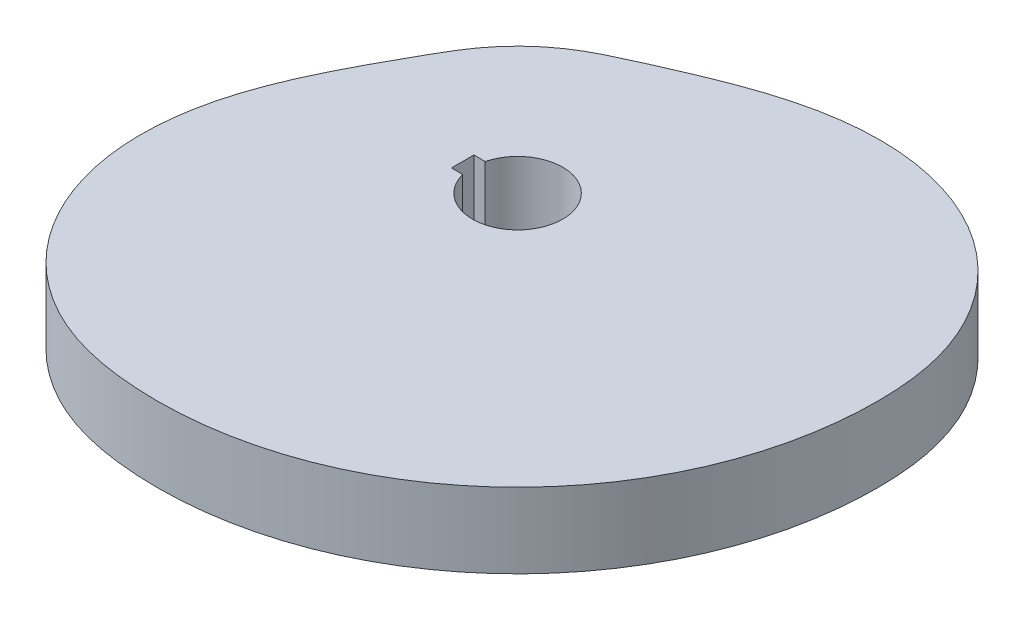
ISO-10303-21;
HEADER;
FILE_DESCRIPTION(('STEP AP214'),'2;1');
FILE_NAME('part.step','',(''),(''),'','','');
FILE_SCHEMA(('AUTOMOTIVE_DESIGN { 1 0 10303 214 1 1 1 1 }'));
ENDSEC;
DATA;
#1=APPLICATION_CONTEXT('core data for automotive mechanical design processes');
#2=APPLICATION_PROTOCOL_DEFINITION('international standard','automotive_design',2000,#1);
#3=PRODUCT_CONTEXT('',#1,'mechanical');
#4=PRODUCT('Part','Part','',(#3));
#5=PRODUCT_RELATED_PRODUCT_CATEGORY('part','',(#4));
#6=PRODUCT_DEFINITION_FORMATION('','',#4);
#7=PRODUCT_DEFINITION_CONTEXT('part definition',#1,'design');
#8=PRODUCT_DEFINITION('design','',#6,#7);
#9=PRODUCT_DEFINITION_SHAPE('','',#8);
#10=(LENGTH_UNIT() NAMED_UNIT(*) SI_UNIT(.MILLI.,.METRE.));
#11=(NAMED_UNIT(*) PLANE_ANGLE_UNIT() SI_UNIT($,.RADIAN.));
#12=(NAMED_UNIT(*) SI_UNIT($,.STERADIAN.) SOLID_ANGLE_UNIT());
#13=UNCERTAINTY_MEASURE_WITH_UNIT(LENGTH_MEASURE(1.E-05),#10,'distance_accuracy_value','');
#14=(GEOMETRIC_REPRESENTATION_CONTEXT(3) GLOBAL_UNCERTAINTY_ASSIGNED_CONTEXT((#13)) GLOBAL_UNIT_ASSIGNED_CONTEXT((#10,
#11,#12)) REPRESENTATION_CONTEXT('',''));
#15=CARTESIAN_POINT('',(0.,0.,0.));
#16=DIRECTION('',(0.,0.,1.));
#17=DIRECTION('',(1.,0.,0.));
#18=AXIS2_PLACEMENT_3D('',#15,#16,#17);
#19=CARTESIAN_POINT('',(0.,-31.75,0.));
#20=DIRECTION('',(0.,1.,0.));
#21=DIRECTION('',(0.,0.,1.));
#22=AXIS2_PLACEMENT_3D('',#19,#20,#21);
#23=PLANE('',#22);
#24=DIRECTION('',(0.,0.,1.));
#25=VECTOR('',#24,1.);
#26=CARTESIAN_POINT('',(-23.2338150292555,-31.75,-4.76250000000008));
#27=LINE('',#26,#25);
#28=CARTESIAN_POINT('',(-23.2338150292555,-31.75,-4.76250000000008));
#29=VERTEX_POINT('',#28);
#30=CARTESIAN_POINT('',(-23.2338150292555,-31.75,4.76249999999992));
#31=VERTEX_POINT('',#30);
#32=EDGE_CURVE('E85',#29,#31,#27,.T.);
#33=ORIENTED_EDGE('',*,*,#32,.T.);
#34=DIRECTION('',(1.,0.,0.));
#35=VECTOR('',#34,1.);
#36=CARTESIAN_POINT('',(-18.4713150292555,-31.75,4.76249999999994));
#37=LINE('',#36,#35);
#38=CARTESIAN_POINT('',(-18.4713150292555,-31.75,4.76249999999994));
#39=VERTEX_POINT('',#38);
#40=EDGE_CURVE('E88',#31,#39,#37,.T.);
#41=ORIENTED_EDGE('',*,*,#40,.T.);
#42=CARTESIAN_POINT('',(0.,-31.75,0.));
#43=DIRECTION('',(0.,1.,0.));
#44=DIRECTION('',(0.,0.,1.));
#45=AXIS2_PLACEMENT_3D('',#42,#43,#44);
#46=CIRCLE('',#45,19.0754);
#47=CARTESIAN_POINT('',(-18.4713150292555,-31.75,-4.76250000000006));
#48=VERTEX_POINT('',#47);
#49=EDGE_CURVE('E11',#39,#48,#46,.T.);
#50=ORIENTED_EDGE('',*,*,#49,.T.);
#51=DIRECTION('',(-1.,0.,0.));
#52=VECTOR('',#51,1.);
#53=CARTESIAN_POINT('',(-18.4713150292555,-31.75,-4.76250000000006));
#54=LINE('',#53,#52);
#55=EDGE_CURVE('E46',#48,#29,#54,.T.);
#56=ORIENTED_EDGE('',*,*,#55,.T.);
#57=EDGE_LOOP('',(#33,#41,#50,#56));
#58=FACE_BOUND('',#57,.T.);
#59=CARTESIAN_POINT('',(152.4,-31.75,0.));
#60=CARTESIAN_POINT('',(152.400005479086,-31.75,-0.970305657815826));
#61=CARTESIAN_POINT('',(152.382430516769,-31.75,-2.81393611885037));
#62=CARTESIAN_POINT('',(152.303857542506,-31.75,-5.52165316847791));
#63=CARTESIAN_POINT('',(152.177967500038,-31.75,-8.11429188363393));
#64=CARTESIAN_POINT('',(152.000701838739,-31.75,-10.6799789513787));
#65=CARTESIAN_POINT('',(151.770703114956,-31.75,-13.2183064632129));
#66=CARTESIAN_POINT('',(151.486738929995,-31.75,-15.7289806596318));
#67=CARTESIAN_POINT('',(151.147703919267,-31.75,-18.2118247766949));
#68=CARTESIAN_POINT('',(150.752617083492,-31.75,-20.666777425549));
#69=CARTESIAN_POINT('',(150.300616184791,-31.75,-23.0938889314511));
#70=CARTESIAN_POINT('',(149.790956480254,-31.75,-25.4933169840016));
#71=CARTESIAN_POINT('',(149.222988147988,-31.75,-27.8653121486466));
#72=CARTESIAN_POINT('',(148.596212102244,-31.75,-30.2102287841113));
#73=CARTESIAN_POINT('',(147.910048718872,-31.75,-32.5284302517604));
#74=CARTESIAN_POINT('',(147.167888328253,-31.75,-34.8107065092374));
#75=CARTESIAN_POINT('',(146.361577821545,-31.75,-37.0766113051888));
#76=CARTESIAN_POINT('',(145.497122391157,-31.75,-39.31698764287));
#77=CARTESIAN_POINT('',(144.568808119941,-31.75,-41.5396227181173));
#78=CARTESIAN_POINT('',(143.586255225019,-31.75,-43.7241706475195));
#79=CARTESIAN_POINT('',(142.546194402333,-31.75,-45.8786232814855));
#80=CARTESIAN_POINT('',(141.449579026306,-31.75,-48.0014674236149));
#81=CARTESIAN_POINT('',(140.297381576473,-31.75,-50.0912088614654));
#82=CARTESIAN_POINT('',(139.090644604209,-31.75,-52.1463940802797));
#83=CARTESIAN_POINT('',(137.830465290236,-31.75,-54.1656076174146));
#84=CARTESIAN_POINT('',(136.517997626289,-31.75,-56.1474758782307));
#85=CARTESIAN_POINT('',(135.154449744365,-31.75,-58.0906691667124));
#86=CARTESIAN_POINT('',(133.74108240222,-31.75,-59.9939041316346));
#87=CARTESIAN_POINT('',(132.279207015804,-31.75,-61.8559460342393));
#88=CARTESIAN_POINT('',(130.770183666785,-31.75,-63.6756109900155));
#89=CARTESIAN_POINT('',(129.215418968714,-31.75,-65.4517681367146));
#90=CARTESIAN_POINT('',(127.616363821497,-31.75,-67.1833417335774));
#91=CARTESIAN_POINT('',(125.974511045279,-31.75,-68.8693131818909));
#92=CARTESIAN_POINT('',(124.291392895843,-31.75,-70.5087229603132));
#93=CARTESIAN_POINT('',(122.568578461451,-31.75,-72.1006724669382));
#94=CARTESIAN_POINT('',(120.807670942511,-31.75,-73.6443257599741));
#95=CARTESIAN_POINT('',(119.010304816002,-31.75,-75.1389111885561));
#96=CARTESIAN_POINT('',(117.178142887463,-31.75,-76.58372290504));
#97=CARTESIAN_POINT('',(115.312873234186,-31.75,-77.9781222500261));
#98=CARTESIAN_POINT('',(113.416206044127,-31.75,-79.3215390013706));
#99=CARTESIAN_POINT('',(111.489870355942,-31.75,-80.6134724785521));
#100=CARTESIAN_POINT('',(109.535610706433,-31.75,-81.8534924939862));
#101=CARTESIAN_POINT('',(107.555183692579,-31.75,-83.0412401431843));
#102=CARTESIAN_POINT('',(105.550354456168,-31.75,-84.1764284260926));
#103=CARTESIAN_POINT('',(103.522893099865,-31.75,-85.2588426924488));
#104=CARTESIAN_POINT('',(101.474571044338,-31.75,-86.2883409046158));
#105=CARTESIAN_POINT('',(99.4071573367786,-31.75,-87.2648537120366));
#106=CARTESIAN_POINT('',(97.3224149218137,-31.75,-88.1883843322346));
#107=CARTESIAN_POINT('',(95.2220968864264,-31.75,-89.0590082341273));
#108=CARTESIAN_POINT('',(93.1079426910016,-31.75,-89.8768726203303));
#109=CARTESIAN_POINT('',(90.9816743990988,-31.75,-90.6421957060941));
#110=CARTESIAN_POINT('',(88.8449929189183,-31.75,-91.3552657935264));
#111=CARTESIAN_POINT('',(86.6995742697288,-31.75,-92.0164401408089));
#112=CARTESIAN_POINT('',(84.5470658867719,-31.75,-92.6261436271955));
#113=CARTESIAN_POINT('',(82.3890829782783,-31.75,-93.1848672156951));
#114=CARTESIAN_POINT('',(80.2272049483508,-31.75,-93.6931662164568));
#115=CARTESIAN_POINT('',(78.0629718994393,-31.75,-94.1516583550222));
#116=CARTESIAN_POINT('',(75.89788122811,-31.75,-94.5610216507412));
#117=CARTESIAN_POINT('',(73.733384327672,-31.75,-94.9219921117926));
#118=CARTESIAN_POINT('',(71.5708834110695,-31.75,-95.2353612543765));
#119=CARTESIAN_POINT('',(69.4117284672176,-31.75,-95.5019734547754));
#120=CARTESIAN_POINT('',(67.2572143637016,-31.75,-95.722723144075));
#121=CARTESIAN_POINT('',(65.1085781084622,-31.75,-95.8985518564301));
#122=CARTESIAN_POINT('',(62.9669962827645,-31.75,-96.0304451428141));
#123=CARTESIAN_POINT('',(60.8335826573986,-31.75,-96.1194293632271));
#124=CARTESIAN_POINT('',(58.7093860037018,-31.75,-96.1665683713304));
#125=CARTESIAN_POINT('',(56.595388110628,-31.75,-96.1729601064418));
#126=CARTESIAN_POINT('',(54.4925020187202,-31.75,-96.1397331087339));
#127=CARTESIAN_POINT('',(52.4015704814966,-31.75,-96.0680429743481));
#128=CARTESIAN_POINT('',(50.3233646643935,-31.75,-95.9590687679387));
#129=CARTESIAN_POINT('',(48.2585830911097,-31.75,-95.8140094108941));
#130=CARTESIAN_POINT('',(46.2078508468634,-31.75,-95.6340800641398));
#131=CARTESIAN_POINT('',(44.1717190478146,-31.75,-95.4205085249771));
#132=CARTESIAN_POINT('',(42.1506645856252,-31.75,-95.1745316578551));
#133=CARTESIAN_POINT('',(40.1450901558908,-31.75,-94.8973918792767));
#134=CARTESIAN_POINT('',(38.1553245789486,-31.75,-94.5903337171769));
#135=CARTESIAN_POINT('',(36.1816234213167,-31.75,-94.2546004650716));
#136=CARTESIAN_POINT('',(34.2241699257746,-31.75,-93.8914309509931));
#137=CARTESIAN_POINT('',(32.2830762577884,-31.75,-93.5020564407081));
#138=CARTESIAN_POINT('',(30.3583850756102,-31.75,-93.0876976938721));
#139=CARTESIAN_POINT('',(28.4500714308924,-31.75,-92.6495621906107));
#140=CARTESIAN_POINT('',(26.5580450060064,-31.75,-92.188841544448));
#141=CARTESIAN_POINT('',(24.682152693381,-31.75,-91.7067091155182));
#142=CARTESIAN_POINT('',(22.8221815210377,-31.75,-91.2043178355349));
#143=CARTESIAN_POINT('',(20.9778619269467,-31.75,-90.6827982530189));
#144=CARTESIAN_POINT('',(19.1488713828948,-31.75,-90.1432568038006));
#145=CARTESIAN_POINT('',(17.3348383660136,-31.75,-89.5867743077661));
#146=CARTESIAN_POINT('',(15.5353466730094,-31.75,-89.0144046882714));
#147=CARTESIAN_POINT('',(13.7499400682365,-31.75,-88.4271739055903));
#148=CARTESIAN_POINT('',(11.9781272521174,-31.75,-87.8260790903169));
#149=CARTESIAN_POINT('',(10.219387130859,-31.75,-87.2120878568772));
#150=CARTESIAN_POINT('',(8.47317436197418,-31.75,-86.5861377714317));
#151=CARTESIAN_POINT('',(6.73892514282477,-31.75,-85.9491359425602));
#152=CARTESIAN_POINT('',(5.01606320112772,-31.75,-85.3019586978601));
#153=CARTESIAN_POINT('',(3.30400593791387,-31.75,-84.6454513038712));
#154=CARTESIAN_POINT('',(1.6021706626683,-31.75,-83.9804276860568));
#155=CARTESIAN_POINT('',(-0.0900191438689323,-31.75,-83.3076700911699));
#156=CARTESIAN_POINT('',(-1.77312763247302,-31.75,-82.6279286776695));
#157=CARTESIAN_POINT('',(-3.44770048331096,-31.75,-81.9419208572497));
#158=CARTESIAN_POINT('',(-5.11425920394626,-31.75,-81.2503308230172));
#159=CARTESIAN_POINT('',(-6.7732951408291,-31.75,-80.5538074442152));
#160=CARTESIAN_POINT('',(-8.42526622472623,-31.75,-79.8529671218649));
#161=CARTESIAN_POINT('',(-10.070585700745,-31.75,-79.1483769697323));
#162=CARTESIAN_POINT('',(-11.7096432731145,-31.75,-78.4406098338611));
#163=CARTESIAN_POINT('',(-13.3427087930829,-31.75,-77.730030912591));
#164=CARTESIAN_POINT('',(-14.9542784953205,-31.75,-77.0245839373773));
#165=CARTESIAN_POINT('',(-16.5755804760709,-31.75,-76.3090299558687));
#166=CARTESIAN_POINT('',(-18.1906217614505,-31.75,-75.5940206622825));
#167=CARTESIAN_POINT('',(-19.8121578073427,-31.75,-74.8721151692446));
#168=CARTESIAN_POINT('',(-21.4048508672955,-31.75,-74.1593542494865));
#169=CARTESIAN_POINT('',(-22.9808203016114,-31.75,-73.449719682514));
#170=CARTESIAN_POINT('',(-24.536212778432,-31.75,-72.7441263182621));
#171=CARTESIAN_POINT('',(-26.0671879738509,-31.75,-72.0431658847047));
#172=CARTESIAN_POINT('',(-27.5700037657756,-31.75,-71.3471655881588));
#173=CARTESIAN_POINT('',(-29.0410752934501,-31.75,-70.656207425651));
#174=CARTESIAN_POINT('',(-30.4770332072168,-31.75,-69.9701684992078));
#175=CARTESIAN_POINT('',(-31.8747725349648,-31.75,-69.2887627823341));
#176=CARTESIAN_POINT('',(-33.2314936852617,-31.75,-68.6115857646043));
#177=CARTESIAN_POINT('',(-34.5447354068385,-31.75,-67.9381563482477));
#178=CARTESIAN_POINT('',(-35.8124008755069,-31.75,-67.2679577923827));
#179=CARTESIAN_POINT('',(-36.9938396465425,-31.75,-66.6217563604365));
#180=CARTESIAN_POINT('',(-38.1737053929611,-31.75,-65.9530782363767));
#181=CARTESIAN_POINT('',(-39.3240800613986,-31.75,-65.2740909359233));
#182=CARTESIAN_POINT('',(-40.4946274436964,-31.75,-64.553968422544));
#183=CARTESIAN_POINT('',(-41.6150821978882,-31.75,-63.8374069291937));
#184=CARTESIAN_POINT('',(-42.7228603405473,-31.75,-63.1014010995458));
#185=CARTESIAN_POINT('',(-43.8176247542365,-31.75,-62.3461736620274));
#186=CARTESIAN_POINT('',(-44.8990418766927,-31.75,-61.571955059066));
#187=CARTESIAN_POINT('',(-45.9667823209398,-31.75,-60.7789810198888));
#188=CARTESIAN_POINT('',(-47.0205208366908,-31.75,-59.9674931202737));
#189=CARTESIAN_POINT('',(-48.0599364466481,-31.75,-59.1377385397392));
#190=CARTESIAN_POINT('',(-49.0847125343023,-31.75,-58.2899700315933));
#191=CARTESIAN_POINT('',(-50.0945369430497,-31.75,-57.4244458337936));
#192=CARTESIAN_POINT('',(-51.0891020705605,-31.75,-56.5414295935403));
#193=CARTESIAN_POINT('',(-52.0681049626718,-31.75,-55.6411902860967));
#194=CARTESIAN_POINT('',(-53.0312474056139,-31.75,-54.7240021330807));
#195=CARTESIAN_POINT('',(-53.9782360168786,-31.75,-53.7901445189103));
#196=CARTESIAN_POINT('',(-54.9087823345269,-31.75,-52.8399019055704));
#197=CARTESIAN_POINT('',(-55.822602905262,-31.75,-51.8735637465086));
#198=CARTESIAN_POINT('',(-56.7194193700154,-31.75,-50.8914243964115));
#199=CARTESIAN_POINT('',(-57.5989585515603,-31.75,-49.8937830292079));
#200=CARTESIAN_POINT('',(-58.4609525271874,-31.75,-48.8809435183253));
#201=CARTESIAN_POINT('',(-59.3051387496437,-31.75,-47.8532144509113));
#202=CARTESIAN_POINT('',(-60.1312599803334,-31.75,-46.8109086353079));
#203=CARTESIAN_POINT('',(-60.9390649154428,-31.75,-45.7543444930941));
#204=CARTESIAN_POINT('',(-61.701998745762,-31.75,-44.7195231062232));
#205=CARTESIAN_POINT('',(-62.4784373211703,-31.75,-43.6289959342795));
#206=CARTESIAN_POINT('',(-63.2486980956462,-31.75,-42.5056970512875));
#207=CARTESIAN_POINT('',(-64.0457953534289,-31.75,-41.3017272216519));
#208=CARTESIAN_POINT('',(-64.8253371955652,-31.75,-40.0881190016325));
#209=CARTESIAN_POINT('',(-65.6121401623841,-31.75,-38.8297881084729));
#210=CARTESIAN_POINT('',(-66.4065255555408,-31.75,-37.5289402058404));
#211=CARTESIAN_POINT('',(-67.2087399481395,-31.75,-36.1881383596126));
#212=CARTESIAN_POINT('',(-68.0189166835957,-31.75,-34.8102685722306));
#213=CARTESIAN_POINT('',(-68.8370360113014,-31.75,-33.3985025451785));
#214=CARTESIAN_POINT('',(-69.6628856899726,-31.75,-31.9562517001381));
#215=CARTESIAN_POINT('',(-70.4960198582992,-31.75,-30.4871108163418));
#216=CARTESIAN_POINT('',(-71.3357431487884,-31.75,-28.9948049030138));
#217=CARTESIAN_POINT('',(-72.181031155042,-31.75,-27.4830906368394));
#218=CARTESIAN_POINT('',(-73.0307375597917,-31.75,-25.9558069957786));
#219=CARTESIAN_POINT('',(-73.8912519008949,-31.75,-24.4010275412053));
#220=CARTESIAN_POINT('',(-74.7458211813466,-31.75,-22.8537245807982));
#221=CARTESIAN_POINT('',(-75.598320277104,-31.75,-21.2989455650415));
#222=CARTESIAN_POINT('',(-76.4416128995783,-31.75,-19.7540868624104));
#223=CARTESIAN_POINT('',(-77.2913110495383,-31.75,-18.1879027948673));
#224=CARTESIAN_POINT('',(-78.1387762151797,-31.75,-16.6155093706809));
#225=CARTESIAN_POINT('',(-78.9834879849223,-31.75,-15.0365008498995));
#226=CARTESIAN_POINT('',(-79.8249489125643,-31.75,-13.4504550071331));
#227=CARTESIAN_POINT('',(-80.6626107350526,-31.75,-11.8568950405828));
#228=CARTESIAN_POINT('',(-81.4958960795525,-31.75,-10.2553049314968));
#229=CARTESIAN_POINT('',(-82.3241940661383,-31.75,-8.64513119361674));
#230=CARTESIAN_POINT('',(-83.1468625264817,-31.75,-7.02578892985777));
#231=CARTESIAN_POINT('',(-83.9632280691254,-31.75,-5.39666725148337));
#232=CARTESIAN_POINT('',(-84.7725863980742,-31.75,-3.75713526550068));
#233=CARTESIAN_POINT('',(-85.5742022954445,-31.75,-2.10654818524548));
#234=CARTESIAN_POINT('',(-86.3673094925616,-31.75,-0.444253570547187));
#235=CARTESIAN_POINT('',(-87.1511104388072,-31.75,1.23040240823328));
#236=CARTESIAN_POINT('',(-87.9247760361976,-31.75,2.91806874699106));
#237=CARTESIAN_POINT('',(-88.6874453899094,-31.75,4.61938348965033));
#238=CARTESIAN_POINT('',(-89.4382256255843,-31.75,6.33496776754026));
#239=CARTESIAN_POINT('',(-90.1761918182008,-31.75,8.06542004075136));
#240=CARTESIAN_POINT('',(-90.9003870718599,-31.75,9.8113105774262));
#241=CARTESIAN_POINT('',(-91.6098227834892,-31.75,11.5731761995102));
#242=CARTESIAN_POINT('',(-92.303479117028,-31.75,13.3515153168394));
#243=CARTESIAN_POINT('',(-92.9803057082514,-31.75,15.1467832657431));
#244=CARTESIAN_POINT('',(-93.6392226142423,-31.75,16.9593879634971));
#245=CARTESIAN_POINT('',(-94.2791215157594,-31.75,18.7896858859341));
#246=CARTESIAN_POINT('',(-94.8988671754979,-31.75,20.6379783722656));
#247=CARTESIAN_POINT('',(-95.4972991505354,-31.75,22.5045082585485));
#248=CARTESIAN_POINT('',(-96.0732337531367,-31.75,24.389456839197));
#249=CARTESIAN_POINT('',(-96.6254662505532,-31.75,26.2929411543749));
#250=CARTESIAN_POINT('',(-97.1527732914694,-31.75,28.2150115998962));
#251=CARTESIAN_POINT('',(-97.653915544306,-31.75,30.1556498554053));
#252=CARTESIAN_POINT('',(-98.1276405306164,-31.75,32.1147671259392));
#253=CARTESIAN_POINT('',(-98.5726856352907,-31.75,34.0922026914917));
#254=CARTESIAN_POINT('',(-98.9877812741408,-31.75,36.0877227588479));
#255=CARTESIAN_POINT('',(-99.3716541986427,-31.75,38.1010196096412));
#256=CARTESIAN_POINT('',(-99.7230309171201,-31.75,40.1317110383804));
#257=CARTESIAN_POINT('',(-100.040641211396,-31.75,42.1793400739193));
#258=CARTESIAN_POINT('',(-100.323221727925,-31.75,44.243374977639));
#259=CARTESIAN_POINT('',(-100.569519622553,-31.75,46.3232095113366));
#260=CARTESIAN_POINT('',(-100.778296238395,-31.75,48.4181634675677));
#261=CARTESIAN_POINT('',(-100.948330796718,-31.75,50.5274834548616));
#262=CARTESIAN_POINT('',(-101.078424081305,-31.75,52.650343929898));
#263=CARTESIAN_POINT('',(-101.16740209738,-31.75,54.7858484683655));
#264=CARTESIAN_POINT('',(-101.214119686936,-31.75,56.9330312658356));
#265=CARTESIAN_POINT('',(-101.217464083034,-31.75,59.0908588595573));
#266=CARTESIAN_POINT('',(-101.17635838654,-31.75,61.2582320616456));
#267=CARTESIAN_POINT('',(-101.089764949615,-31.75,63.4339880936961));
#268=CARTESIAN_POINT('',(-100.956688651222,-31.75,65.6169029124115));
#269=CARTESIAN_POINT('',(-100.776180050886,-31.75,67.8056937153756));
#270=CARTESIAN_POINT('',(-100.54733840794,-31.75,69.9990216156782));
#271=CARTESIAN_POINT('',(-100.269314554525,-31.75,72.1954944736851));
#272=CARTESIAN_POINT('',(-99.9413136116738,-31.75,74.3936698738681));
#273=CARTESIAN_POINT('',(-99.5625975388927,-31.75,76.5920582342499));
#274=CARTESIAN_POINT('',(-99.1324875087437,-31.75,78.7891260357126));
#275=CARTESIAN_POINT('',(-98.6503660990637,-31.75,80.9832991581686));
#276=CARTESIAN_POINT('',(-98.1156792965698,-31.75,83.1729663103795));
#277=CARTESIAN_POINT('',(-97.5279383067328,-31.75,85.3564825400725));
#278=CARTESIAN_POINT('',(-96.8867211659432,-31.75,87.5321728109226));
#279=CARTESIAN_POINT('',(-96.1916741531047,-31.75,89.6983356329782));
#280=CARTESIAN_POINT('',(-95.4425129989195,-31.75,91.8532467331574));
#281=CARTESIAN_POINT('',(-94.6390238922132,-31.75,93.995162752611));
#282=CARTESIAN_POINT('',(-93.7810642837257,-31.75,96.1223249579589));
#283=CARTESIAN_POINT('',(-92.8685634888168,-31.75,98.2329629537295));
#284=CARTESIAN_POINT('',(-91.9015230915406,-31.75,100.3252983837));
#285=CARTESIAN_POINT('',(-90.8800171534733,-31.75,102.397548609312));
#286=CARTESIAN_POINT('',(-89.8041922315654,-31.75,104.447930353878));
#287=CARTESIAN_POINT('',(-88.674267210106,-31.75,106.474663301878));
#288=CARTESIAN_POINT('',(-87.4905329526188,-31.75,108.475973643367));
#289=CARTESIAN_POINT('',(-86.2533517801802,-31.75,110.45009755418));
#290=CARTESIAN_POINT('',(-84.9631567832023,-31.75,112.395284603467));
#291=CARTESIAN_POINT('',(-83.6204509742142,-31.75,114.309801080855));
#292=CARTESIAN_POINT('',(-82.2258062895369,-31.75,116.191933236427));
#293=CARTESIAN_POINT('',(-80.7798624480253,-31.75,118.039990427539));
#294=CARTESIAN_POINT('',(-79.2833256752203,-31.75,119.852308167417));
#295=CARTESIAN_POINT('',(-77.736967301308,-31.75,121.627251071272));
#296=CARTESIAN_POINT('',(-76.1416222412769,-31.75,123.363215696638));
#297=CARTESIAN_POINT('',(-74.4981873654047,-31.75,125.058633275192));
#298=CARTESIAN_POINT('',(-72.8076197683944,-31.75,126.711972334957));
#299=CARTESIAN_POINT('',(-71.0709349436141,-31.75,128.32174120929));
#300=CARTESIAN_POINT('',(-69.2892048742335,-31.75,129.8864904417));
#301=CARTESIAN_POINT('',(-67.4635560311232,-31.75,131.404815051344));
#302=CARTESIAN_POINT('',(-65.5951673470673,-31.75,132.875356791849));
#303=CARTESIAN_POINT('',(-63.6852679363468,-31.75,134.296805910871));
#304=CARTESIAN_POINT('',(-61.7351354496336,-31.75,135.667904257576));
#305=CARTESIAN_POINT('',(-59.7460917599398,-31.75,136.987442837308));
#306=CARTESIAN_POINT('',(-57.7195083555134,-31.75,138.254279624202));
#307=CARTESIAN_POINT('',(-55.6567751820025,-31.75,139.467281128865));
#308=CARTESIAN_POINT('',(-53.5594059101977,-31.75,140.625548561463));
#309=CARTESIAN_POINT('',(-51.4193776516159,-31.75,141.732366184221));
#310=CARTESIAN_POINT('',(-49.2572985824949,-31.75,142.778910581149));
#311=CARTESIAN_POINT('',(-47.0633974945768,-31.75,143.766659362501));
#312=CARTESIAN_POINT('',(-44.8484958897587,-31.75,144.693914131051));
#313=CARTESIAN_POINT('',(-42.5925531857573,-31.75,145.568021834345));
#314=CARTESIAN_POINT('',(-40.3048052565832,-31.75,146.385524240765));
#315=CARTESIAN_POINT('',(-37.9848734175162,-31.75,147.146870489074));
#316=CARTESIAN_POINT('',(-35.6324883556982,-31.75,147.852655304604));
#317=CARTESIAN_POINT('',(-33.2474715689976,-31.75,148.503554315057));
#318=CARTESIAN_POINT('',(-30.8297549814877,-31.75,149.100347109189));
#319=CARTESIAN_POINT('',(-28.3793871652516,-31.75,149.643917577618));
#320=CARTESIAN_POINT('',(-25.8965397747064,-31.75,150.135260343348));
#321=CARTESIAN_POINT('',(-23.3815108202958,-31.75,150.575484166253));
#322=CARTESIAN_POINT('',(-20.8347249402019,-31.75,150.965814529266));
#323=CARTESIAN_POINT('',(-18.2567350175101,-31.75,151.307590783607));
#324=CARTESIAN_POINT('',(-15.7362859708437,-31.75,151.592320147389));
#325=CARTESIAN_POINT('',(-13.1032561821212,-31.75,151.84340384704));
#326=CARTESIAN_POINT('',(-10.454561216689,-31.75,152.049548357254));
#327=CARTESIAN_POINT('',(-7.71075624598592,-31.75,152.212556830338));
#328=CARTESIAN_POINT('',(-5.05310553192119,-31.75,152.323946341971));
#329=CARTESIAN_POINT('',(-2.3939167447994,-31.75,152.388935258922));
#330=CARTESIAN_POINT('',(0.266001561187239,-31.75,152.407505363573));
#331=CARTESIAN_POINT('',(2.9258387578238,-31.75,152.379650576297));
#332=CARTESIAN_POINT('',(5.58478473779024,-31.75,152.305379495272));
#333=CARTESIAN_POINT('',(8.24202953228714,-31.75,152.184714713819));
#334=CARTESIAN_POINT('',(10.8967637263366,-31.75,152.017692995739));
#335=CARTESIAN_POINT('',(13.5481786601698,-31.75,151.804365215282));
#336=CARTESIAN_POINT('',(16.1954666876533,-31.75,151.544796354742));
#337=CARTESIAN_POINT('',(18.8378214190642,-31.75,151.239065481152));
#338=CARTESIAN_POINT('',(21.4744379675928,-31.75,150.88726572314));
#339=CARTESIAN_POINT('',(24.1045131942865,-31.75,150.489504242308));
#340=CARTESIAN_POINT('',(26.7272459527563,-31.75,150.045902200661));
#341=CARTESIAN_POINT('',(29.3418373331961,-31.75,149.556594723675));
#342=CARTESIAN_POINT('',(31.9474909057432,-31.75,149.021730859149));
#343=CARTESIAN_POINT('',(34.5434129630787,-31.75,148.441473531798));
#344=CARTESIAN_POINT('',(37.128812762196,-31.75,147.815999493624));
#345=CARTESIAN_POINT('',(39.7029027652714,-31.75,147.145499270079));
#346=CARTESIAN_POINT('',(42.2648988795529,-31.75,146.430177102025));
#347=CARTESIAN_POINT('',(44.8140206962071,-31.75,145.670250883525));
#348=CARTESIAN_POINT('',(47.3494917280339,-31.75,144.865952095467));
#349=CARTESIAN_POINT('',(49.8705396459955,-31.75,144.017525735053));
#350=CARTESIAN_POINT('',(52.3763965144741,-31.75,143.12523024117));
#351=CARTESIAN_POINT('',(54.8662990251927,-31.75,142.189337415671));
#352=CARTESIAN_POINT('',(57.3394887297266,-31.75,141.210132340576));
#353=CARTESIAN_POINT('',(59.7952122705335,-31.75,140.187913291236));
#354=CARTESIAN_POINT('',(62.2327216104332,-31.75,139.122991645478));
#355=CARTESIAN_POINT('',(64.6512742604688,-31.75,138.015691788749));
#356=CARTESIAN_POINT('',(67.0501335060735,-31.75,136.866351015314));
#357=CARTESIAN_POINT('',(69.4285686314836,-31.75,135.675319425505));
#358=CARTESIAN_POINT('',(71.7858551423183,-31.75,134.442959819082));
#359=CARTESIAN_POINT('',(74.1212749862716,-31.75,133.169647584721));
#360=CARTESIAN_POINT('',(76.434116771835,-31.75,131.855770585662));
#361=CARTESIAN_POINT('',(78.7236759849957,-31.75,130.501729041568));
#362=CARTESIAN_POINT('',(80.9892552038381,-31.75,129.107935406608));
#363=CARTESIAN_POINT('',(83.230164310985,-31.75,127.674814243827));
#364=CARTESIAN_POINT('',(85.4457207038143,-31.75,126.202802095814));
#365=CARTESIAN_POINT('',(87.6352495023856,-31.75,124.692347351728));
#366=CARTESIAN_POINT('',(89.7980837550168,-31.75,123.143910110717));
#367=CARTESIAN_POINT('',(91.9335646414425,-31.75,121.557962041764));
#368=CARTESIAN_POINT('',(94.0410416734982,-31.75,119.934986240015));
#369=CARTESIAN_POINT('',(96.1198728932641,-31.75,118.275477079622));
#370=CARTESIAN_POINT('',(98.1694250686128,-31.75,116.579940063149));
#371=CARTESIAN_POINT('',(100.189073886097,-31.75,114.848891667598));
#372=CARTESIAN_POINT('',(102.178204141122,-31.75,113.082859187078));
#373=CARTESIAN_POINT('',(104.136209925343,-31.75,111.282380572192));
#374=CARTESIAN_POINT('',(106.062494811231,-31.75,109.448004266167));
#375=CARTESIAN_POINT('',(107.956472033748,-31.75,107.580289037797));
#376=CARTESIAN_POINT('',(109.817564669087,-31.75,105.679803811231));
#377=CARTESIAN_POINT('',(111.6452058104,-31.75,103.747127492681));
#378=CARTESIAN_POINT('',(113.438838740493,-31.75,101.782848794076));
#379=CARTESIAN_POINT('',(115.197917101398,-31.75,99.7875660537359));
#380=CARTESIAN_POINT('',(116.921905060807,-31.75,97.761887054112));
#381=CARTESIAN_POINT('',(118.610277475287,-31.75,95.7064288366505));
#382=CARTESIAN_POINT('',(120.262520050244,-31.75,93.6218175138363));
#383=CARTESIAN_POINT('',(121.878129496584,-31.75,91.5086880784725));
#384=CARTESIAN_POINT('',(123.45661368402,-31.75,89.3676842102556));
#385=CARTESIAN_POINT('',(124.997491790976,-31.75,87.1994580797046));
#386=CARTESIAN_POINT('',(126.500294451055,-31.75,85.0046701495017));
#387=CARTESIAN_POINT('',(127.964563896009,-31.75,82.7839889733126));
#388=CARTESIAN_POINT('',(129.389854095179,-31.75,80.5380909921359));
#389=CARTESIAN_POINT('',(130.775730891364,-31.75,78.2676603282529));
#390=CARTESIAN_POINT('',(132.121772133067,-31.75,75.9733885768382));
#391=CARTESIAN_POINT('',(133.427567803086,-31.75,73.6559745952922));
#392=CARTESIAN_POINT('',(134.69272014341,-31.75,71.3161242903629));
#393=CARTESIAN_POINT('',(135.91684377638,-31.75,68.9545504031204));
#394=CARTESIAN_POINT('',(137.09956582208,-31.75,66.5719722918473));
#395=CARTESIAN_POINT('',(138.240526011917,-31.75,64.1691157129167));
#396=CARTESIAN_POINT('',(139.339376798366,-31.75,61.7467125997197));
#397=CARTESIAN_POINT('',(140.39578346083,-31.75,59.3055008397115));
#398=CARTESIAN_POINT('',(141.409424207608,-31.75,56.8462240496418));
#399=CARTESIAN_POINT('',(142.379990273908,-31.75,54.3696313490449));
#400=CARTESIAN_POINT('',(143.307186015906,-31.75,51.8764771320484));
#401=CARTESIAN_POINT('',(144.190729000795,-31.75,49.3675208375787));
#402=CARTESIAN_POINT('',(145.030350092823,-31.75,46.8435267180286));
#403=CARTESIAN_POINT('',(145.825793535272,-31.75,44.3052636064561));
#404=CARTESIAN_POINT('',(146.576817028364,-31.75,41.7535046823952));
#405=CARTESIAN_POINT('',(147.283191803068,-31.75,39.1890272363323));
#406=CARTESIAN_POINT('',(147.944702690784,-31.75,36.6126124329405));
#407=CARTESIAN_POINT('',(148.561148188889,-31.75,34.0250450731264));
#408=CARTESIAN_POINT('',(149.132340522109,-31.75,31.4271133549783));
#409=CARTESIAN_POINT('',(149.658105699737,-31.75,28.8196086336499));
#410=CARTESIAN_POINT('',(150.138283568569,-31.75,26.2033251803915));
#411=CARTESIAN_POINT('',(150.572727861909,-31.75,23.5790599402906));
#412=CARTESIAN_POINT('',(150.961306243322,-31.75,20.9476122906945));
#413=CARTESIAN_POINT('',(151.303900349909,-31.75,18.3097837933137));
#414=CARTESIAN_POINT('',(151.600405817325,-31.75,15.6663779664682));
#415=CARTESIAN_POINT('',(151.850732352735,-31.75,13.0181999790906));
#416=CARTESIAN_POINT('',(152.0548036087,-31.75,10.3660566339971));
#417=CARTESIAN_POINT('',(152.21255777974,-31.75,7.71075526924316));
#418=CARTESIAN_POINT('',(152.323945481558,-31.75,5.05310669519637));
#419=CARTESIAN_POINT('',(152.386771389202,-31.75,2.48255093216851));
#420=CARTESIAN_POINT('',(152.399995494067,-31.75,0.797967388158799));
#421=CARTESIAN_POINT('',(152.4,-31.75,0.));
#422=B_SPLINE_CURVE_WITH_KNOTS('',3,(#59,#60,#61,#62,#63,#64,#65,#66,#67,#68,#69,#70,#71,#72,
#73,#74,#75,#76,#77,#78,#79,#80,#81,#82,#83,#84,#85,#86,#87,#88,#89,#90,#91,#92,#93,#94,#95,#96,
#97,#98,#99,#100,#101,#102,#103,#104,#105,#106,#107,#108,#109,#110,#111,#112,#113,#114,#115,
#116,#117,#118,#119,#120,#121,#122,#123,#124,#125,#126,#127,#128,#129,#130,#131,#132,#133,#134,
#135,#136,#137,#138,#139,#140,#141,#142,#143,#144,#145,#146,#147,#148,#149,#150,#151,#152,#153,
#154,#155,#156,#157,#158,#159,#160,#161,#162,#163,#164,#165,#166,#167,#168,#169,#170,#171,#172,
#173,#174,#175,#176,#177,#178,#179,#180,#181,#182,#183,#184,#185,#186,#187,#188,#189,#190,#191,
#192,#193,#194,#195,#196,#197,#198,#199,#200,#201,#202,#203,#204,#205,#206,#207,#208,#209,#210,
#211,#212,#213,#214,#215,#216,#217,#218,#219,#220,#221,#222,#223,#224,#225,#226,#227,#228,#229,
#230,#231,#232,#233,#234,#235,#236,#237,#238,#239,#240,#241,#242,#243,#244,#245,#246,#247,#248,
#249,#250,#251,#252,#253,#254,#255,#256,#257,#258,#259,#260,#261,#262,#263,#264,#265,#266,#267,
#268,#269,#270,#271,#272,#273,#274,#275,#276,#277,#278,#279,#280,#281,#282,#283,#284,#285,#286,
#287,#288,#289,#290,#291,#292,#293,#294,#295,#296,#297,#298,#299,#300,#301,#302,#303,#304,#305,
#306,#307,#308,#309,#310,#311,#312,#313,#314,#315,#316,#317,#318,#319,#320,#321,#322,#323,#324,
#325,#326,#327,#328,#329,#330,#331,#332,#333,#334,#335,#336,#337,#338,#339,#340,#341,#342,#343,
#344,#345,#346,#347,#348,#349,#350,#351,#352,#353,#354,#355,#356,#357,#358,#359,#360,#361,#362,
#363,#364,#365,#366,#367,#368,#369,#370,#371,#372,#373,#374,#375,#376,#377,#378,#379,#380,#381,
#382,#383,#384,#385,#386,#387,#388,#389,#390,#391,#392,#393,#394,#395,#396,#397,#398,#399,#400,
#401,#402,#403,#404,#405,#406,#407,#408,#409,#410,#411,#412,#413,#414,#415,#416,#417,#418,#419,
#420,#421),.UNSPECIFIED.,.T.,.F.,(4,1,1,1,1,1,1,1,1,1,1,1,1,1,1,1,1,1,1,1,1,1,1,1,1,1,1,1,1,1,1,
1,1,1,1,1,1,1,1,1,1,1,1,1,1,1,1,1,1,1,1,1,1,1,1,1,1,1,1,1,1,1,1,1,1,1,1,1,1,1,1,1,1,1,1,1,1,1,1,
1,1,1,1,1,1,1,1,1,1,1,1,1,1,1,1,1,1,1,1,1,1,1,1,1,1,1,1,1,1,1,1,1,1,1,1,1,1,1,1,1,1,1,1,1,1,1,1,
1,1,1,1,1,1,1,1,1,1,1,1,1,1,1,1,1,1,1,1,1,1,1,1,1,1,1,1,1,1,1,1,1,1,1,1,1,1,1,1,1,1,1,1,1,1,1,1,
1,1,1,1,1,1,1,1,1,1,1,1,1,1,1,1,1,1,1,1,1,1,1,1,1,1,1,1,1,1,1,1,1,1,1,1,1,1,1,1,1,1,1,1,1,1,1,1,
1,1,1,1,1,1,1,1,1,1,1,1,1,1,1,1,1,1,1,1,1,1,1,1,1,1,1,1,1,1,1,1,1,1,1,1,1,1,1,1,1,1,1,1,1,1,1,1,
1,1,1,1,1,1,1,1,1,1,1,1,1,1,1,1,1,1,1,1,1,1,1,1,1,1,1,1,1,1,1,1,1,1,1,1,1,1,1,1,1,1,1,1,1,1,1,1,
1,1,1,1,1,1,1,1,1,1,1,1,1,1,1,1,1,1,1,1,1,1,1,1,1,1,1,1,1,1,1,1,1,1,1,1,1,1,1,1,1,4),(0.,
0.00367891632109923,0.00699006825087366,0.010270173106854,0.0135199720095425,0.01674049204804,
0.0199330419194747,0.0230992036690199,0.026240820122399,0.0293599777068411,0.0324589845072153,
0.0355403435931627,0.0386067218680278,0.0416609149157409,0.0447058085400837,0.0477049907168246,
0.0507788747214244,0.0538096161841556,0.0568366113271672,0.0598598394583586,0.0628792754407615,
0.0658948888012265,0.068906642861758,0.0719144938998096,0.0749183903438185,0.0779182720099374,
0.0809140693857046,0.0839057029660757,0.0868930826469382,0.0898761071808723,0.0928546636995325,
0.0958286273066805,0.0987978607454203,0.101762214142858,0.104721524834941,0.107675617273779,
0.110624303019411,0.113567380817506,0.116504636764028,0.119435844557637,0.122360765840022,
0.125279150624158,0.128190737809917,0.131095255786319,0.13399242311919,0.136881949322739,
0.139763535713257,0.142636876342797,0.145501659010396,0.148357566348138,0.151204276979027,
0.154041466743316,0.156868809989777,0.15968598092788,0.162492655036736,0.165288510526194,
0.168073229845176,0.170846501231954,0.173608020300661,0.176357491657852,0.179094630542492,
0.181819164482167,0.184530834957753,0.187229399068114,0.189914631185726,0.192586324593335,
0.195244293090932,0.197888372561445,0.200518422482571,0.203134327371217,0.205735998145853,
0.208323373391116,0.21089642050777,0.213455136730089,0.21599954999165,0.218529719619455,
0.221045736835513,0.223547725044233,0.226035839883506,0.228510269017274,0.230971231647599,
0.233418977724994,0.235853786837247,0.238275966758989,0.240685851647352,0.243083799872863,
0.24547019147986,0.247845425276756,0.250209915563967,0.252564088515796,0.254908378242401,
0.257243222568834,0.259569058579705,0.26188631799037,0.264195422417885,0.266496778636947,
0.268790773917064,0.271077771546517,0.273358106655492,0.27563208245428,0.277899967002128,
0.280161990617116,0.282418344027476,0.284669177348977,0.286914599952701,0.289088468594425,
0.291388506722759,0.293611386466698,0.295818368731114,0.298004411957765,0.300164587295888,
0.302294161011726,0.304388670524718,0.306443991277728,0.30845639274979,0.310422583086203,
0.312339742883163,0.314205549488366,0.316018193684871,0.317776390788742,0.319311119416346,
0.321160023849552,0.322840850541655,0.324521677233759,0.326202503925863,0.327883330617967,
0.32956415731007,0.331244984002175,0.332925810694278,0.334606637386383,0.336287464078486,
0.33796829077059,0.339649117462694,0.341329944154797,0.343010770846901,0.344691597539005,
0.34637242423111,0.348053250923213,0.349734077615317,0.35141490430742,0.353095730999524,
0.354776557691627,0.356457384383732,0.358138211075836,0.35981903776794,0.361331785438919,
0.363213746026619,0.36498290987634,0.36680630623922,0.368682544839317,0.370609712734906,
0.372585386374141,0.374606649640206,0.376670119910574,0.378771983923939,0.380908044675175,
0.383073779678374,0.385264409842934,0.38747497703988,0.389700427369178,0.392002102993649,
0.39417695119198,0.396423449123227,0.398675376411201,0.400932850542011,0.403196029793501,
0.405465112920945,0.407740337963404,0.410021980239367,0.412310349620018,0.414605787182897,
0.416908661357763,0.419219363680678,0.421538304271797,0.423865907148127,0.426202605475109,
0.42854883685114,0.430905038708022,0.433271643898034,0.435649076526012,0.438037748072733,
0.440438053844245,0.442850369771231,0.445275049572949,0.447712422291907,0.450162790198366,
0.452626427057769,0.455103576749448,0.457594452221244,0.460099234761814,0.462618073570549,
0.465151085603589,0.467698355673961,0.47025993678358,0.472835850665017,0.475426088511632,
0.478030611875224,0.480649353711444,0.483282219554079,0.485929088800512,0.488589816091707,
0.49126423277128,0.49395214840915,0.496653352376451,0.499367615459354,0.502094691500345,
0.504834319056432,0.507586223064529,0.510350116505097,0.51312570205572,0.51591267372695,
0.518710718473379,0.521519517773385,0.52433874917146,0.527168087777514,0.530007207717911,
0.532855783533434,0.535713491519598,0.538580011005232,0.541455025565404,0.544338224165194,
0.547229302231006,0.550127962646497,0.553033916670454,0.555946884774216,0.558866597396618,
0.561792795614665,0.564725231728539,0.567663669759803,0.570607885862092,0.57355766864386,
0.576512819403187,0.579473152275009,0.582438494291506,0.585408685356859,0.588383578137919,
0.591363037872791,0.594346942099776,0.597335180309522,0.600327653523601,0.603324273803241,
0.606324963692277,0.609329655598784,0.612338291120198,0.615350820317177,0.618367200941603,
0.621387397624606,0.624411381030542,0.6274391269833,0.630470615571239,0.633545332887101,
0.636545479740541,0.639591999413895,0.642648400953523,0.645717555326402,0.64880223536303,
0.651905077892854,0.655028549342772,0.658174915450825,0.661346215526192,0.664544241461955,
0.66777052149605,0.671026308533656,0.674312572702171,0.677629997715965,0.680642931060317,
0.684340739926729,0.687702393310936,0.691064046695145,0.694425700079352,0.697787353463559,
0.701149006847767,0.704510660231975,0.707872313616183,0.71123396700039,0.714595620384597,
0.717957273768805,0.721318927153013,0.724680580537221,0.728042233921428,0.731403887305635,
0.734765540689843,0.73812719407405,0.741488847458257,0.744850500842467,0.748212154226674,
0.751573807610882,0.754935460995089,0.758297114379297,0.761658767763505,0.765020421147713,
0.76838207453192,0.771743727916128,0.775105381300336,0.778467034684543,0.78182868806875,
0.785190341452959,0.788551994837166,0.791913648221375,0.795275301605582,0.79863695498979,
0.801998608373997,0.805360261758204,0.808721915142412,0.81208356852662,0.815445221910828,
0.818806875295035,0.822168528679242,0.825530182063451,0.828891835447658,0.832253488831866,
0.835615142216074,0.838976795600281,0.842338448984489,0.845700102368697,0.849061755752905,
0.852423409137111,0.85578506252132,0.859146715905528,0.862508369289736,0.865870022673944,
0.869231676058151,0.872593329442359,0.875954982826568,0.879316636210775,0.882678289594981,
0.88603994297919,0.889401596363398,0.892763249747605,0.896124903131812,0.899486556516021,
0.902848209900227,0.906209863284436,0.909571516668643,0.912933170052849,0.916294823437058,
0.919656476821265,0.923018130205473,0.926379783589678,0.929741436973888,0.933103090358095,
0.936464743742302,0.939826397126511,0.943188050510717,0.946549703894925,0.949911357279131,
0.953273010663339,0.956634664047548,0.959996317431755,0.963357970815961,0.96671962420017,
0.970081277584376,0.973442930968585,0.976804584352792,0.980166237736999,0.983527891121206,
0.986889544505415,0.990251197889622,0.993612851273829,0.996974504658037,1.),.UNSPECIFIED.);
#423=CARTESIAN_POINT('',(152.4,-31.75,0.));
#424=VERTEX_POINT('',#423);
#425=EDGE_CURVE('E96',#424,#424,#422,.T.);
#426=ORIENTED_EDGE('',*,*,#425,.F.);
#427=EDGE_LOOP('',(#426));
#428=FACE_BOUND('',#427,.T.);
#429=ADVANCED_FACE('F31',(#58,#428),#23,.F.);
#430=CARTESIAN_POINT('',(0.,0.,0.));
#431=DIRECTION('',(0.,1.,0.));
#432=DIRECTION('',(0.,0.,1.));
#433=AXIS2_PLACEMENT_3D('',#430,#431,#432);
#434=PLANE('',#433);
#435=DIRECTION('',(1.,0.,0.));
#436=VECTOR('',#435,1.);
#437=CARTESIAN_POINT('',(-18.4713150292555,0.,4.76249999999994));
#438=LINE('',#437,#436);
#439=CARTESIAN_POINT('',(-23.2338150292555,0.,4.76249999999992));
#440=VERTEX_POINT('',#439);
#441=CARTESIAN_POINT('',(-18.4713150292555,0.,4.76249999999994));
#442=VERTEX_POINT('',#441);
#443=EDGE_CURVE('E71',#440,#442,#438,.T.);
#444=ORIENTED_EDGE('',*,*,#443,.F.);
#445=DIRECTION('',(0.,0.,1.));
#446=VECTOR('',#445,1.);
#447=CARTESIAN_POINT('',(-23.2338150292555,0.,-4.76250000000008));
#448=LINE('',#447,#446);
#449=CARTESIAN_POINT('',(-23.2338150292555,0.,-4.76250000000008));
#450=VERTEX_POINT('',#449);
#451=EDGE_CURVE('E93',#450,#440,#448,.T.);
#452=ORIENTED_EDGE('',*,*,#451,.F.);
#453=DIRECTION('',(-1.,0.,0.));
#454=VECTOR('',#453,1.);
#455=CARTESIAN_POINT('',(-18.4713150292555,0.,-4.76250000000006));
#456=LINE('',#455,#454);
#457=CARTESIAN_POINT('',(-18.4713150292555,0.,-4.76250000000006));
#458=VERTEX_POINT('',#457);
#459=EDGE_CURVE('E77',#458,#450,#456,.T.);
#460=ORIENTED_EDGE('',*,*,#459,.F.);
#461=CARTESIAN_POINT('',(0.,0.,0.));
#462=DIRECTION('',(0.,1.,0.));
#463=DIRECTION('',(0.,0.,1.));
#464=AXIS2_PLACEMENT_3D('',#461,#462,#463);
#465=CIRCLE('',#464,19.0754);
#466=EDGE_CURVE('E35',#442,#458,#465,.T.);
#467=ORIENTED_EDGE('',*,*,#466,.F.);
#468=EDGE_LOOP('',(#444,#452,#460,#467));
#469=FACE_BOUND('',#468,.T.);
#470=CARTESIAN_POINT('',(152.4,0.,0.));
#471=CARTESIAN_POINT('',(152.400005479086,0.,-0.970305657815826));
#472=CARTESIAN_POINT('',(152.382430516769,0.,-2.81393611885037));
#473=CARTESIAN_POINT('',(152.303857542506,0.,-5.52165316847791));
#474=CARTESIAN_POINT('',(152.177967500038,0.,-8.11429188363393));
#475=CARTESIAN_POINT('',(152.000701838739,0.,-10.6799789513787));
#476=CARTESIAN_POINT('',(151.770703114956,0.,-13.2183064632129));
#477=CARTESIAN_POINT('',(151.486738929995,0.,-15.7289806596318));
#478=CARTESIAN_POINT('',(151.147703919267,0.,-18.2118247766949));
#479=CARTESIAN_POINT('',(150.752617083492,0.,-20.666777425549));
#480=CARTESIAN_POINT('',(150.300616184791,0.,-23.0938889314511));
#481=CARTESIAN_POINT('',(149.790956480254,0.,-25.4933169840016));
#482=CARTESIAN_POINT('',(149.222988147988,0.,-27.8653121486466));
#483=CARTESIAN_POINT('',(148.596212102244,0.,-30.2102287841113));
#484=CARTESIAN_POINT('',(147.910048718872,0.,-32.5284302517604));
#485=CARTESIAN_POINT('',(147.167888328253,0.,-34.8107065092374));
#486=CARTESIAN_POINT('',(146.361577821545,0.,-37.0766113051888));
#487=CARTESIAN_POINT('',(145.497122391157,0.,-39.31698764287));
#488=CARTESIAN_POINT('',(144.568808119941,0.,-41.5396227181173));
#489=CARTESIAN_POINT('',(143.586255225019,0.,-43.7241706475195));
#490=CARTESIAN_POINT('',(142.546194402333,0.,-45.8786232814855));
#491=CARTESIAN_POINT('',(141.449579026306,0.,-48.0014674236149));
#492=CARTESIAN_POINT('',(140.297381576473,0.,-50.0912088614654));
#493=CARTESIAN_POINT('',(139.090644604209,0.,-52.1463940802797));
#494=CARTESIAN_POINT('',(137.830465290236,0.,-54.1656076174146));
#495=CARTESIAN_POINT('',(136.517997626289,0.,-56.1474758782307));
#496=CARTESIAN_POINT('',(135.154449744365,0.,-58.0906691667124));
#497=CARTESIAN_POINT('',(133.74108240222,0.,-59.9939041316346));
#498=CARTESIAN_POINT('',(132.279207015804,0.,-61.8559460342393));
#499=CARTESIAN_POINT('',(130.770183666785,0.,-63.6756109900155));
#500=CARTESIAN_POINT('',(129.215418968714,0.,-65.4517681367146));
#501=CARTESIAN_POINT('',(127.616363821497,0.,-67.1833417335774));
#502=CARTESIAN_POINT('',(125.974511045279,0.,-68.8693131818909));
#503=CARTESIAN_POINT('',(124.291392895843,0.,-70.5087229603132));
#504=CARTESIAN_POINT('',(122.568578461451,0.,-72.1006724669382));
#505=CARTESIAN_POINT('',(120.807670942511,0.,-73.6443257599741));
#506=CARTESIAN_POINT('',(119.010304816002,0.,-75.1389111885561));
#507=CARTESIAN_POINT('',(117.178142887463,0.,-76.58372290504));
#508=CARTESIAN_POINT('',(115.312873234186,0.,-77.9781222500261));
#509=CARTESIAN_POINT('',(113.416206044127,0.,-79.3215390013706));
#510=CARTESIAN_POINT('',(111.489870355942,0.,-80.6134724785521));
#511=CARTESIAN_POINT('',(109.535610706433,0.,-81.8534924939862));
#512=CARTESIAN_POINT('',(107.555183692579,0.,-83.0412401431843));
#513=CARTESIAN_POINT('',(105.550354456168,0.,-84.1764284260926));
#514=CARTESIAN_POINT('',(103.522893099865,0.,-85.2588426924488));
#515=CARTESIAN_POINT('',(101.474571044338,0.,-86.2883409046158));
#516=CARTESIAN_POINT('',(99.4071573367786,0.,-87.2648537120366));
#517=CARTESIAN_POINT('',(97.3224149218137,0.,-88.1883843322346));
#518=CARTESIAN_POINT('',(95.2220968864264,0.,-89.0590082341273));
#519=CARTESIAN_POINT('',(93.1079426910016,0.,-89.8768726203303));
#520=CARTESIAN_POINT('',(90.9816743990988,0.,-90.6421957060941));
#521=CARTESIAN_POINT('',(88.8449929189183,0.,-91.3552657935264));
#522=CARTESIAN_POINT('',(86.6995742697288,0.,-92.0164401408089));
#523=CARTESIAN_POINT('',(84.5470658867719,0.,-92.6261436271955));
#524=CARTESIAN_POINT('',(82.3890829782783,0.,-93.1848672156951));
#525=CARTESIAN_POINT('',(80.2272049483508,0.,-93.6931662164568));
#526=CARTESIAN_POINT('',(78.0629718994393,0.,-94.1516583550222));
#527=CARTESIAN_POINT('',(75.89788122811,0.,-94.5610216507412));
#528=CARTESIAN_POINT('',(73.733384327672,0.,-94.9219921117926));
#529=CARTESIAN_POINT('',(71.5708834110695,0.,-95.2353612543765));
#530=CARTESIAN_POINT('',(69.4117284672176,0.,-95.5019734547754));
#531=CARTESIAN_POINT('',(67.2572143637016,0.,-95.722723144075));
#532=CARTESIAN_POINT('',(65.1085781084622,0.,-95.8985518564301));
#533=CARTESIAN_POINT('',(62.9669962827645,0.,-96.0304451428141));
#534=CARTESIAN_POINT('',(60.8335826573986,0.,-96.1194293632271));
#535=CARTESIAN_POINT('',(58.7093860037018,0.,-96.1665683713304));
#536=CARTESIAN_POINT('',(56.595388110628,0.,-96.1729601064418));
#537=CARTESIAN_POINT('',(54.4925020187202,0.,-96.1397331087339));
#538=CARTESIAN_POINT('',(52.4015704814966,0.,-96.0680429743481));
#539=CARTESIAN_POINT('',(50.3233646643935,0.,-95.9590687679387));
#540=CARTESIAN_POINT('',(48.2585830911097,0.,-95.8140094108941));
#541=CARTESIAN_POINT('',(46.2078508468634,0.,-95.6340800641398));
#542=CARTESIAN_POINT('',(44.1717190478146,0.,-95.4205085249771));
#543=CARTESIAN_POINT('',(42.1506645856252,0.,-95.1745316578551));
#544=CARTESIAN_POINT('',(40.1450901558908,0.,-94.8973918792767));
#545=CARTESIAN_POINT('',(38.1553245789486,0.,-94.5903337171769));
#546=CARTESIAN_POINT('',(36.1816234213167,0.,-94.2546004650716));
#547=CARTESIAN_POINT('',(34.2241699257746,0.,-93.8914309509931));
#548=CARTESIAN_POINT('',(32.2830762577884,0.,-93.5020564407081));
#549=CARTESIAN_POINT('',(30.3583850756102,0.,-93.0876976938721));
#550=CARTESIAN_POINT('',(28.4500714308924,0.,-92.6495621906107));
#551=CARTESIAN_POINT('',(26.5580450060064,0.,-92.188841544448));
#552=CARTESIAN_POINT('',(24.682152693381,0.,-91.7067091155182));
#553=CARTESIAN_POINT('',(22.8221815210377,0.,-91.2043178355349));
#554=CARTESIAN_POINT('',(20.9778619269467,0.,-90.6827982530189));
#555=CARTESIAN_POINT('',(19.1488713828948,0.,-90.1432568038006));
#556=CARTESIAN_POINT('',(17.3348383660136,0.,-89.5867743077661));
#557=CARTESIAN_POINT('',(15.5353466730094,0.,-89.0144046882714));
#558=CARTESIAN_POINT('',(13.7499400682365,0.,-88.4271739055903));
#559=CARTESIAN_POINT('',(11.9781272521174,0.,-87.8260790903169));
#560=CARTESIAN_POINT('',(10.219387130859,0.,-87.2120878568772));
#561=CARTESIAN_POINT('',(8.47317436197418,0.,-86.5861377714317));
#562=CARTESIAN_POINT('',(6.73892514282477,0.,-85.9491359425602));
#563=CARTESIAN_POINT('',(5.01606320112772,0.,-85.3019586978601));
#564=CARTESIAN_POINT('',(3.30400593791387,0.,-84.6454513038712));
#565=CARTESIAN_POINT('',(1.6021706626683,0.,-83.9804276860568));
#566=CARTESIAN_POINT('',(-0.0900191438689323,0.,-83.3076700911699));
#567=CARTESIAN_POINT('',(-1.77312763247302,0.,-82.6279286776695));
#568=CARTESIAN_POINT('',(-3.44770048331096,0.,-81.9419208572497));
#569=CARTESIAN_POINT('',(-5.11425920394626,0.,-81.2503308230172));
#570=CARTESIAN_POINT('',(-6.7732951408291,0.,-80.5538074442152));
#571=CARTESIAN_POINT('',(-8.42526622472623,0.,-79.8529671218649));
#572=CARTESIAN_POINT('',(-10.070585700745,0.,-79.1483769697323));
#573=CARTESIAN_POINT('',(-11.7096432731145,0.,-78.4406098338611));
#574=CARTESIAN_POINT('',(-13.3427087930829,0.,-77.730030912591));
#575=CARTESIAN_POINT('',(-14.9542784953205,0.,-77.0245839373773));
#576=CARTESIAN_POINT('',(-16.5755804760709,0.,-76.3090299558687));
#577=CARTESIAN_POINT('',(-18.1906217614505,0.,-75.5940206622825));
#578=CARTESIAN_POINT('',(-19.8121578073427,0.,-74.8721151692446));
#579=CARTESIAN_POINT('',(-21.4048508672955,0.,-74.1593542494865));
#580=CARTESIAN_POINT('',(-22.9808203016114,0.,-73.449719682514));
#581=CARTESIAN_POINT('',(-24.536212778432,0.,-72.7441263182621));
#582=CARTESIAN_POINT('',(-26.0671879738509,0.,-72.0431658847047));
#583=CARTESIAN_POINT('',(-27.5700037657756,0.,-71.3471655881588));
#584=CARTESIAN_POINT('',(-29.0410752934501,0.,-70.656207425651));
#585=CARTESIAN_POINT('',(-30.4770332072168,0.,-69.9701684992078));
#586=CARTESIAN_POINT('',(-31.8747725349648,0.,-69.2887627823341));
#587=CARTESIAN_POINT('',(-33.2314936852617,0.,-68.6115857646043));
#588=CARTESIAN_POINT('',(-34.5447354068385,0.,-67.9381563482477));
#589=CARTESIAN_POINT('',(-35.8124008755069,0.,-67.2679577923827));
#590=CARTESIAN_POINT('',(-36.9938396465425,0.,-66.6217563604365));
#591=CARTESIAN_POINT('',(-38.1737053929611,0.,-65.9530782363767));
#592=CARTESIAN_POINT('',(-39.3240800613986,0.,-65.2740909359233));
#593=CARTESIAN_POINT('',(-40.4946274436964,0.,-64.553968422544));
#594=CARTESIAN_POINT('',(-41.6150821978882,0.,-63.8374069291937));
#595=CARTESIAN_POINT('',(-42.7228603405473,0.,-63.1014010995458));
#596=CARTESIAN_POINT('',(-43.8176247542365,0.,-62.3461736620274));
#597=CARTESIAN_POINT('',(-44.8990418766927,0.,-61.571955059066));
#598=CARTESIAN_POINT('',(-45.9667823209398,0.,-60.7789810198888));
#599=CARTESIAN_POINT('',(-47.0205208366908,0.,-59.9674931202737));
#600=CARTESIAN_POINT('',(-48.0599364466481,0.,-59.1377385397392));
#601=CARTESIAN_POINT('',(-49.0847125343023,0.,-58.2899700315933));
#602=CARTESIAN_POINT('',(-50.0945369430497,0.,-57.4244458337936));
#603=CARTESIAN_POINT('',(-51.0891020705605,0.,-56.5414295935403));
#604=CARTESIAN_POINT('',(-52.0681049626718,0.,-55.6411902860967));
#605=CARTESIAN_POINT('',(-53.0312474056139,0.,-54.7240021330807));
#606=CARTESIAN_POINT('',(-53.9782360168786,0.,-53.7901445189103));
#607=CARTESIAN_POINT('',(-54.9087823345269,0.,-52.8399019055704));
#608=CARTESIAN_POINT('',(-55.822602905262,0.,-51.8735637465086));
#609=CARTESIAN_POINT('',(-56.7194193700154,0.,-50.8914243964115));
#610=CARTESIAN_POINT('',(-57.5989585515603,0.,-49.8937830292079));
#611=CARTESIAN_POINT('',(-58.4609525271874,0.,-48.8809435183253));
#612=CARTESIAN_POINT('',(-59.3051387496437,0.,-47.8532144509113));
#613=CARTESIAN_POINT('',(-60.1312599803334,0.,-46.8109086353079));
#614=CARTESIAN_POINT('',(-60.9390649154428,0.,-45.7543444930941));
#615=CARTESIAN_POINT('',(-61.701998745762,0.,-44.7195231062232));
#616=CARTESIAN_POINT('',(-62.4784373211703,0.,-43.6289959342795));
#617=CARTESIAN_POINT('',(-63.2486980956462,0.,-42.5056970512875));
#618=CARTESIAN_POINT('',(-64.0457953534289,0.,-41.3017272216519));
#619=CARTESIAN_POINT('',(-64.8253371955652,0.,-40.0881190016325));
#620=CARTESIAN_POINT('',(-65.6121401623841,0.,-38.8297881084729));
#621=CARTESIAN_POINT('',(-66.4065255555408,0.,-37.5289402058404));
#622=CARTESIAN_POINT('',(-67.2087399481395,0.,-36.1881383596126));
#623=CARTESIAN_POINT('',(-68.0189166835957,0.,-34.8102685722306));
#624=CARTESIAN_POINT('',(-68.8370360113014,0.,-33.3985025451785));
#625=CARTESIAN_POINT('',(-69.6628856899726,0.,-31.9562517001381));
#626=CARTESIAN_POINT('',(-70.4960198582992,0.,-30.4871108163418));
#627=CARTESIAN_POINT('',(-71.3357431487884,0.,-28.9948049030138));
#628=CARTESIAN_POINT('',(-72.181031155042,0.,-27.4830906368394));
#629=CARTESIAN_POINT('',(-73.0307375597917,0.,-25.9558069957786));
#630=CARTESIAN_POINT('',(-73.8912519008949,0.,-24.4010275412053));
#631=CARTESIAN_POINT('',(-74.7458211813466,0.,-22.8537245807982));
#632=CARTESIAN_POINT('',(-75.598320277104,0.,-21.2989455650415));
#633=CARTESIAN_POINT('',(-76.4416128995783,0.,-19.7540868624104));
#634=CARTESIAN_POINT('',(-77.2913110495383,0.,-18.1879027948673));
#635=CARTESIAN_POINT('',(-78.1387762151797,0.,-16.6155093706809));
#636=CARTESIAN_POINT('',(-78.9834879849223,0.,-15.0365008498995));
#637=CARTESIAN_POINT('',(-79.8249489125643,0.,-13.4504550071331));
#638=CARTESIAN_POINT('',(-80.6626107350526,0.,-11.8568950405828));
#639=CARTESIAN_POINT('',(-81.4958960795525,0.,-10.2553049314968));
#640=CARTESIAN_POINT('',(-82.3241940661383,0.,-8.64513119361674));
#641=CARTESIAN_POINT('',(-83.1468625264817,0.,-7.02578892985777));
#642=CARTESIAN_POINT('',(-83.9632280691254,0.,-5.39666725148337));
#643=CARTESIAN_POINT('',(-84.7725863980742,0.,-3.75713526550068));
#644=CARTESIAN_POINT('',(-85.5742022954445,0.,-2.10654818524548));
#645=CARTESIAN_POINT('',(-86.3673094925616,0.,-0.444253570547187));
#646=CARTESIAN_POINT('',(-87.1511104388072,0.,1.23040240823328));
#647=CARTESIAN_POINT('',(-87.9247760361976,0.,2.91806874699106));
#648=CARTESIAN_POINT('',(-88.6874453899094,0.,4.61938348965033));
#649=CARTESIAN_POINT('',(-89.4382256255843,0.,6.33496776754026));
#650=CARTESIAN_POINT('',(-90.1761918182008,0.,8.06542004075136));
#651=CARTESIAN_POINT('',(-90.9003870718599,0.,9.8113105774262));
#652=CARTESIAN_POINT('',(-91.6098227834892,0.,11.5731761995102));
#653=CARTESIAN_POINT('',(-92.303479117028,0.,13.3515153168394));
#654=CARTESIAN_POINT('',(-92.9803057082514,0.,15.1467832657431));
#655=CARTESIAN_POINT('',(-93.6392226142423,0.,16.9593879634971));
#656=CARTESIAN_POINT('',(-94.2791215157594,0.,18.7896858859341));
#657=CARTESIAN_POINT('',(-94.8988671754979,0.,20.6379783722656));
#658=CARTESIAN_POINT('',(-95.4972991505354,0.,22.5045082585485));
#659=CARTESIAN_POINT('',(-96.0732337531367,0.,24.389456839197));
#660=CARTESIAN_POINT('',(-96.6254662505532,0.,26.2929411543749));
#661=CARTESIAN_POINT('',(-97.1527732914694,0.,28.2150115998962));
#662=CARTESIAN_POINT('',(-97.653915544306,0.,30.1556498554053));
#663=CARTESIAN_POINT('',(-98.1276405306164,0.,32.1147671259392));
#664=CARTESIAN_POINT('',(-98.5726856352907,0.,34.0922026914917));
#665=CARTESIAN_POINT('',(-98.9877812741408,0.,36.0877227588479));
#666=CARTESIAN_POINT('',(-99.3716541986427,0.,38.1010196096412));
#667=CARTESIAN_POINT('',(-99.7230309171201,0.,40.1317110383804));
#668=CARTESIAN_POINT('',(-100.040641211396,0.,42.1793400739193));
#669=CARTESIAN_POINT('',(-100.323221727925,0.,44.243374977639));
#670=CARTESIAN_POINT('',(-100.569519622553,0.,46.3232095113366));
#671=CARTESIAN_POINT('',(-100.778296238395,0.,48.4181634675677));
#672=CARTESIAN_POINT('',(-100.948330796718,0.,50.5274834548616));
#673=CARTESIAN_POINT('',(-101.078424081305,0.,52.650343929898));
#674=CARTESIAN_POINT('',(-101.16740209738,0.,54.7858484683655));
#675=CARTESIAN_POINT('',(-101.214119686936,0.,56.9330312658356));
#676=CARTESIAN_POINT('',(-101.217464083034,0.,59.0908588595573));
#677=CARTESIAN_POINT('',(-101.17635838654,0.,61.2582320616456));
#678=CARTESIAN_POINT('',(-101.089764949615,0.,63.4339880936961));
#679=CARTESIAN_POINT('',(-100.956688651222,0.,65.6169029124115));
#680=CARTESIAN_POINT('',(-100.776180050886,0.,67.8056937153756));
#681=CARTESIAN_POINT('',(-100.54733840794,0.,69.9990216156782));
#682=CARTESIAN_POINT('',(-100.269314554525,0.,72.1954944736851));
#683=CARTESIAN_POINT('',(-99.9413136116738,0.,74.3936698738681));
#684=CARTESIAN_POINT('',(-99.5625975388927,0.,76.5920582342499));
#685=CARTESIAN_POINT('',(-99.1324875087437,0.,78.7891260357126));
#686=CARTESIAN_POINT('',(-98.6503660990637,0.,80.9832991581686));
#687=CARTESIAN_POINT('',(-98.1156792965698,0.,83.1729663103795));
#688=CARTESIAN_POINT('',(-97.5279383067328,0.,85.3564825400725));
#689=CARTESIAN_POINT('',(-96.8867211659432,0.,87.5321728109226));
#690=CARTESIAN_POINT('',(-96.1916741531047,0.,89.6983356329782));
#691=CARTESIAN_POINT('',(-95.4425129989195,0.,91.8532467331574));
#692=CARTESIAN_POINT('',(-94.6390238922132,0.,93.995162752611));
#693=CARTESIAN_POINT('',(-93.7810642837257,0.,96.1223249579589));
#694=CARTESIAN_POINT('',(-92.8685634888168,0.,98.2329629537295));
#695=CARTESIAN_POINT('',(-91.9015230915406,0.,100.3252983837));
#696=CARTESIAN_POINT('',(-90.8800171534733,0.,102.397548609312));
#697=CARTESIAN_POINT('',(-89.8041922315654,0.,104.447930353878));
#698=CARTESIAN_POINT('',(-88.674267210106,0.,106.474663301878));
#699=CARTESIAN_POINT('',(-87.4905329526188,0.,108.475973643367));
#700=CARTESIAN_POINT('',(-86.2533517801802,0.,110.45009755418));
#701=CARTESIAN_POINT('',(-84.9631567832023,0.,112.395284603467));
#702=CARTESIAN_POINT('',(-83.6204509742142,0.,114.309801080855));
#703=CARTESIAN_POINT('',(-82.2258062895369,0.,116.191933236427));
#704=CARTESIAN_POINT('',(-80.7798624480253,0.,118.039990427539));
#705=CARTESIAN_POINT('',(-79.2833256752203,0.,119.852308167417));
#706=CARTESIAN_POINT('',(-77.736967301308,0.,121.627251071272));
#707=CARTESIAN_POINT('',(-76.1416222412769,0.,123.363215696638));
#708=CARTESIAN_POINT('',(-74.4981873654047,0.,125.058633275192));
#709=CARTESIAN_POINT('',(-72.8076197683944,0.,126.711972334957));
#710=CARTESIAN_POINT('',(-71.0709349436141,0.,128.32174120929));
#711=CARTESIAN_POINT('',(-69.2892048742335,0.,129.8864904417));
#712=CARTESIAN_POINT('',(-67.4635560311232,0.,131.404815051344));
#713=CARTESIAN_POINT('',(-65.5951673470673,0.,132.875356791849));
#714=CARTESIAN_POINT('',(-63.6852679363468,0.,134.296805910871));
#715=CARTESIAN_POINT('',(-61.7351354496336,0.,135.667904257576));
#716=CARTESIAN_POINT('',(-59.7460917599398,0.,136.987442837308));
#717=CARTESIAN_POINT('',(-57.7195083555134,0.,138.254279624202));
#718=CARTESIAN_POINT('',(-55.6567751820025,0.,139.467281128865));
#719=CARTESIAN_POINT('',(-53.5594059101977,0.,140.625548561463));
#720=CARTESIAN_POINT('',(-51.4193776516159,0.,141.732366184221));
#721=CARTESIAN_POINT('',(-49.2572985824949,0.,142.778910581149));
#722=CARTESIAN_POINT('',(-47.0633974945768,0.,143.766659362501));
#723=CARTESIAN_POINT('',(-44.8484958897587,0.,144.693914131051));
#724=CARTESIAN_POINT('',(-42.5925531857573,0.,145.568021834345));
#725=CARTESIAN_POINT('',(-40.3048052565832,0.,146.385524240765));
#726=CARTESIAN_POINT('',(-37.9848734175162,0.,147.146870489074));
#727=CARTESIAN_POINT('',(-35.6324883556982,0.,147.852655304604));
#728=CARTESIAN_POINT('',(-33.2474715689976,0.,148.503554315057));
#729=CARTESIAN_POINT('',(-30.8297549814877,0.,149.100347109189));
#730=CARTESIAN_POINT('',(-28.3793871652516,0.,149.643917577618));
#731=CARTESIAN_POINT('',(-25.8965397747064,0.,150.135260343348));
#732=CARTESIAN_POINT('',(-23.3815108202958,0.,150.575484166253));
#733=CARTESIAN_POINT('',(-20.8347249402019,0.,150.965814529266));
#734=CARTESIAN_POINT('',(-18.2567350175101,0.,151.307590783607));
#735=CARTESIAN_POINT('',(-15.7362859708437,0.,151.592320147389));
#736=CARTESIAN_POINT('',(-13.1032561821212,0.,151.84340384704));
#737=CARTESIAN_POINT('',(-10.454561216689,0.,152.049548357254));
#738=CARTESIAN_POINT('',(-7.71075624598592,0.,152.212556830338));
#739=CARTESIAN_POINT('',(-5.05310553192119,0.,152.323946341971));
#740=CARTESIAN_POINT('',(-2.3939167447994,0.,152.388935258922));
#741=CARTESIAN_POINT('',(0.266001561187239,0.,152.407505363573));
#742=CARTESIAN_POINT('',(2.9258387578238,0.,152.379650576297));
#743=CARTESIAN_POINT('',(5.58478473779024,0.,152.305379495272));
#744=CARTESIAN_POINT('',(8.24202953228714,0.,152.184714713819));
#745=CARTESIAN_POINT('',(10.8967637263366,0.,152.017692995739));
#746=CARTESIAN_POINT('',(13.5481786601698,0.,151.804365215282));
#747=CARTESIAN_POINT('',(16.1954666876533,0.,151.544796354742));
#748=CARTESIAN_POINT('',(18.8378214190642,0.,151.239065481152));
#749=CARTESIAN_POINT('',(21.4744379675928,0.,150.88726572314));
#750=CARTESIAN_POINT('',(24.1045131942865,0.,150.489504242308));
#751=CARTESIAN_POINT('',(26.7272459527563,0.,150.045902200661));
#752=CARTESIAN_POINT('',(29.3418373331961,0.,149.556594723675));
#753=CARTESIAN_POINT('',(31.9474909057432,0.,149.021730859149));
#754=CARTESIAN_POINT('',(34.5434129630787,0.,148.441473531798));
#755=CARTESIAN_POINT('',(37.128812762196,0.,147.815999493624));
#756=CARTESIAN_POINT('',(39.7029027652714,0.,147.145499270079));
#757=CARTESIAN_POINT('',(42.2648988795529,0.,146.430177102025));
#758=CARTESIAN_POINT('',(44.8140206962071,0.,145.670250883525));
#759=CARTESIAN_POINT('',(47.3494917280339,0.,144.865952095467));
#760=CARTESIAN_POINT('',(49.8705396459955,0.,144.017525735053));
#761=CARTESIAN_POINT('',(52.3763965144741,0.,143.12523024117));
#762=CARTESIAN_POINT('',(54.8662990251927,0.,142.189337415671));
#763=CARTESIAN_POINT('',(57.3394887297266,0.,141.210132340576));
#764=CARTESIAN_POINT('',(59.7952122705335,0.,140.187913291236));
#765=CARTESIAN_POINT('',(62.2327216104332,0.,139.122991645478));
#766=CARTESIAN_POINT('',(64.6512742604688,0.,138.015691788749));
#767=CARTESIAN_POINT('',(67.0501335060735,0.,136.866351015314));
#768=CARTESIAN_POINT('',(69.4285686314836,0.,135.675319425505));
#769=CARTESIAN_POINT('',(71.7858551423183,0.,134.442959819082));
#770=CARTESIAN_POINT('',(74.1212749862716,0.,133.169647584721));
#771=CARTESIAN_POINT('',(76.434116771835,0.,131.855770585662));
#772=CARTESIAN_POINT('',(78.7236759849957,0.,130.501729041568));
#773=CARTESIAN_POINT('',(80.9892552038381,0.,129.107935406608));
#774=CARTESIAN_POINT('',(83.230164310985,0.,127.674814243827));
#775=CARTESIAN_POINT('',(85.4457207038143,0.,126.202802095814));
#776=CARTESIAN_POINT('',(87.6352495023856,0.,124.692347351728));
#777=CARTESIAN_POINT('',(89.7980837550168,0.,123.143910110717));
#778=CARTESIAN_POINT('',(91.9335646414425,0.,121.557962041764));
#779=CARTESIAN_POINT('',(94.0410416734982,0.,119.934986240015));
#780=CARTESIAN_POINT('',(96.1198728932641,0.,118.275477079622));
#781=CARTESIAN_POINT('',(98.1694250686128,0.,116.579940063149));
#782=CARTESIAN_POINT('',(100.189073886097,0.,114.848891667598));
#783=CARTESIAN_POINT('',(102.178204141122,0.,113.082859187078));
#784=CARTESIAN_POINT('',(104.136209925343,0.,111.282380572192));
#785=CARTESIAN_POINT('',(106.062494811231,0.,109.448004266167));
#786=CARTESIAN_POINT('',(107.956472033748,0.,107.580289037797));
#787=CARTESIAN_POINT('',(109.817564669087,0.,105.679803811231));
#788=CARTESIAN_POINT('',(111.6452058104,0.,103.747127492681));
#789=CARTESIAN_POINT('',(113.438838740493,0.,101.782848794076));
#790=CARTESIAN_POINT('',(115.197917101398,0.,99.7875660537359));
#791=CARTESIAN_POINT('',(116.921905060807,0.,97.761887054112));
#792=CARTESIAN_POINT('',(118.610277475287,0.,95.7064288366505));
#793=CARTESIAN_POINT('',(120.262520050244,0.,93.6218175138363));
#794=CARTESIAN_POINT('',(121.878129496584,0.,91.5086880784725));
#795=CARTESIAN_POINT('',(123.45661368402,0.,89.3676842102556));
#796=CARTESIAN_POINT('',(124.997491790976,0.,87.1994580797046));
#797=CARTESIAN_POINT('',(126.500294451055,0.,85.0046701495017));
#798=CARTESIAN_POINT('',(127.964563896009,0.,82.7839889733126));
#799=CARTESIAN_POINT('',(129.389854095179,0.,80.5380909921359));
#800=CARTESIAN_POINT('',(130.775730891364,0.,78.2676603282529));
#801=CARTESIAN_POINT('',(132.121772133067,0.,75.9733885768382));
#802=CARTESIAN_POINT('',(133.427567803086,0.,73.6559745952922));
#803=CARTESIAN_POINT('',(134.69272014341,0.,71.3161242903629));
#804=CARTESIAN_POINT('',(135.91684377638,0.,68.9545504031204));
#805=CARTESIAN_POINT('',(137.09956582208,0.,66.5719722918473));
#806=CARTESIAN_POINT('',(138.240526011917,0.,64.1691157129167));
#807=CARTESIAN_POINT('',(139.339376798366,0.,61.7467125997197));
#808=CARTESIAN_POINT('',(140.39578346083,0.,59.3055008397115));
#809=CARTESIAN_POINT('',(141.409424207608,0.,56.8462240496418));
#810=CARTESIAN_POINT('',(142.379990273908,0.,54.3696313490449));
#811=CARTESIAN_POINT('',(143.307186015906,0.,51.8764771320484));
#812=CARTESIAN_POINT('',(144.190729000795,0.,49.3675208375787));
#813=CARTESIAN_POINT('',(145.030350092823,0.,46.8435267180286));
#814=CARTESIAN_POINT('',(145.825793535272,0.,44.3052636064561));
#815=CARTESIAN_POINT('',(146.576817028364,0.,41.7535046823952));
#816=CARTESIAN_POINT('',(147.283191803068,0.,39.1890272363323));
#817=CARTESIAN_POINT('',(147.944702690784,0.,36.6126124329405));
#818=CARTESIAN_POINT('',(148.561148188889,0.,34.0250450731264));
#819=CARTESIAN_POINT('',(149.132340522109,0.,31.4271133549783));
#820=CARTESIAN_POINT('',(149.658105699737,0.,28.8196086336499));
#821=CARTESIAN_POINT('',(150.138283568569,0.,26.2033251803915));
#822=CARTESIAN_POINT('',(150.572727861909,0.,23.5790599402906));
#823=CARTESIAN_POINT('',(150.961306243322,0.,20.9476122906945));
#824=CARTESIAN_POINT('',(151.303900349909,0.,18.3097837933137));
#825=CARTESIAN_POINT('',(151.600405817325,0.,15.6663779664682));
#826=CARTESIAN_POINT('',(151.850732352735,0.,13.0181999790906));
#827=CARTESIAN_POINT('',(152.0548036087,0.,10.3660566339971));
#828=CARTESIAN_POINT('',(152.21255777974,0.,7.71075526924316));
#829=CARTESIAN_POINT('',(152.323945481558,0.,5.05310669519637));
#830=CARTESIAN_POINT('',(152.386771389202,0.,2.48255093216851));
#831=CARTESIAN_POINT('',(152.399995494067,0.,0.797967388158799));
#832=CARTESIAN_POINT('',(152.4,0.,0.));
#833=B_SPLINE_CURVE_WITH_KNOTS('',3,(#470,#471,#472,#473,#474,#475,#476,#477,#478,#479,#480,
#481,#482,#483,#484,#485,#486,#487,#488,#489,#490,#491,#492,#493,#494,#495,#496,#497,#498,#499,
#500,#501,#502,#503,#504,#505,#506,#507,#508,#509,#510,#511,#512,#513,#514,#515,#516,#517,#518,
#519,#520,#521,#522,#523,#524,#525,#526,#527,#528,#529,#530,#531,#532,#533,#534,#535,#536,#537,
#538,#539,#540,#541,#542,#543,#544,#545,#546,#547,#548,#549,#550,#551,#552,#553,#554,#555,#556,
#557,#558,#559,#560,#561,#562,#563,#564,#565,#566,#567,#568,#569,#570,#571,#572,#573,#574,#575,
#576,#577,#578,#579,#580,#581,#582,#583,#584,#585,#586,#587,#588,#589,#590,#591,#592,#593,#594,
#595,#596,#597,#598,#599,#600,#601,#602,#603,#604,#605,#606,#607,#608,#609,#610,#611,#612,#613,
#614,#615,#616,#617,#618,#619,#620,#621,#622,#623,#624,#625,#626,#627,#628,#629,#630,#631,#632,
#633,#634,#635,#636,#637,#638,#639,#640,#641,#642,#643,#644,#645,#646,#647,#648,#649,#650,#651,
#652,#653,#654,#655,#656,#657,#658,#659,#660,#661,#662,#663,#664,#665,#666,#667,#668,#669,#670,
#671,#672,#673,#674,#675,#676,#677,#678,#679,#680,#681,#682,#683,#684,#685,#686,#687,#688,#689,
#690,#691,#692,#693,#694,#695,#696,#697,#698,#699,#700,#701,#702,#703,#704,#705,#706,#707,#708,
#709,#710,#711,#712,#713,#714,#715,#716,#717,#718,#719,#720,#721,#722,#723,#724,#725,#726,#727,
#728,#729,#730,#731,#732,#733,#734,#735,#736,#737,#738,#739,#740,#741,#742,#743,#744,#745,#746,
#747,#748,#749,#750,#751,#752,#753,#754,#755,#756,#757,#758,#759,#760,#761,#762,#763,#764,#765,
#766,#767,#768,#769,#770,#771,#772,#773,#774,#775,#776,#777,#778,#779,#780,#781,#782,#783,#784,
#785,#786,#787,#788,#789,#790,#791,#792,#793,#794,#795,#796,#797,#798,#799,#800,#801,#802,#803,
#804,#805,#806,#807,#808,#809,#810,#811,#812,#813,#814,#815,#816,#817,#818,#819,#820,#821,#822,
#823,#824,#825,#826,#827,#828,#829,#830,#831,#832),.UNSPECIFIED.,.T.,.F.,(4,1,1,1,1,1,1,1,1,1,1,
1,1,1,1,1,1,1,1,1,1,1,1,1,1,1,1,1,1,1,1,1,1,1,1,1,1,1,1,1,1,1,1,1,1,1,1,1,1,1,1,1,1,1,1,1,1,1,1,
1,1,1,1,1,1,1,1,1,1,1,1,1,1,1,1,1,1,1,1,1,1,1,1,1,1,1,1,1,1,1,1,1,1,1,1,1,1,1,1,1,1,1,1,1,1,1,1,
1,1,1,1,1,1,1,1,1,1,1,1,1,1,1,1,1,1,1,1,1,1,1,1,1,1,1,1,1,1,1,1,1,1,1,1,1,1,1,1,1,1,1,1,1,1,1,1,
1,1,1,1,1,1,1,1,1,1,1,1,1,1,1,1,1,1,1,1,1,1,1,1,1,1,1,1,1,1,1,1,1,1,1,1,1,1,1,1,1,1,1,1,1,1,1,1,
1,1,1,1,1,1,1,1,1,1,1,1,1,1,1,1,1,1,1,1,1,1,1,1,1,1,1,1,1,1,1,1,1,1,1,1,1,1,1,1,1,1,1,1,1,1,1,1,
1,1,1,1,1,1,1,1,1,1,1,1,1,1,1,1,1,1,1,1,1,1,1,1,1,1,1,1,1,1,1,1,1,1,1,1,1,1,1,1,1,1,1,1,1,1,1,1,
1,1,1,1,1,1,1,1,1,1,1,1,1,1,1,1,1,1,1,1,1,1,1,1,1,1,1,1,1,1,1,1,1,1,1,1,1,1,1,1,1,1,1,1,1,1,1,1,
1,1,1,1,1,1,1,1,1,1,1,1,1,4),(0.,0.00367891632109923,0.00699006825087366,0.010270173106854,
0.0135199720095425,0.01674049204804,0.0199330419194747,0.0230992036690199,0.026240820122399,
0.0293599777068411,0.0324589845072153,0.0355403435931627,0.0386067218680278,0.0416609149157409,
0.0447058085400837,0.0477049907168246,0.0507788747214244,0.0538096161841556,0.0568366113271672,
0.0598598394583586,0.0628792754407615,0.0658948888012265,0.068906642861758,0.0719144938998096,
0.0749183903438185,0.0779182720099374,0.0809140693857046,0.0839057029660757,0.0868930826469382,
0.0898761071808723,0.0928546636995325,0.0958286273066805,0.0987978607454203,0.101762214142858,
0.104721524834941,0.107675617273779,0.110624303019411,0.113567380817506,0.116504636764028,
0.119435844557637,0.122360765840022,0.125279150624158,0.128190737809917,0.131095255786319,
0.13399242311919,0.136881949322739,0.139763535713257,0.142636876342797,0.145501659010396,
0.148357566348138,0.151204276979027,0.154041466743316,0.156868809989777,0.15968598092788,
0.162492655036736,0.165288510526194,0.168073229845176,0.170846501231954,0.173608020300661,
0.176357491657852,0.179094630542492,0.181819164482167,0.184530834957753,0.187229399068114,
0.189914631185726,0.192586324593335,0.195244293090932,0.197888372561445,0.200518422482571,
0.203134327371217,0.205735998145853,0.208323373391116,0.21089642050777,0.213455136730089,
0.21599954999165,0.218529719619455,0.221045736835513,0.223547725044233,0.226035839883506,
0.228510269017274,0.230971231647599,0.233418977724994,0.235853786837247,0.238275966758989,
0.240685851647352,0.243083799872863,0.24547019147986,0.247845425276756,0.250209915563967,
0.252564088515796,0.254908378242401,0.257243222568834,0.259569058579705,0.26188631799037,
0.264195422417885,0.266496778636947,0.268790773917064,0.271077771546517,0.273358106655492,
0.27563208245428,0.277899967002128,0.280161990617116,0.282418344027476,0.284669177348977,
0.286914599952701,0.289088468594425,0.291388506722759,0.293611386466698,0.295818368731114,
0.298004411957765,0.300164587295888,0.302294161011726,0.304388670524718,0.306443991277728,
0.30845639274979,0.310422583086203,0.312339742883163,0.314205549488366,0.316018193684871,
0.317776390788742,0.319311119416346,0.321160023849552,0.322840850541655,0.324521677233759,
0.326202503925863,0.327883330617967,0.32956415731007,0.331244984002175,0.332925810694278,
0.334606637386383,0.336287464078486,0.33796829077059,0.339649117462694,0.341329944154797,
0.343010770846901,0.344691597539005,0.34637242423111,0.348053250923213,0.349734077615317,
0.35141490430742,0.353095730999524,0.354776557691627,0.356457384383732,0.358138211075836,
0.35981903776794,0.361331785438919,0.363213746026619,0.36498290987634,0.36680630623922,
0.368682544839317,0.370609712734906,0.372585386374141,0.374606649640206,0.376670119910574,
0.378771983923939,0.380908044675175,0.383073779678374,0.385264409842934,0.38747497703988,
0.389700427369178,0.392002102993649,0.39417695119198,0.396423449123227,0.398675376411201,
0.400932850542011,0.403196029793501,0.405465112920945,0.407740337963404,0.410021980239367,
0.412310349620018,0.414605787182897,0.416908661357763,0.419219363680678,0.421538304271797,
0.423865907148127,0.426202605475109,0.42854883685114,0.430905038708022,0.433271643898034,
0.435649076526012,0.438037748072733,0.440438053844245,0.442850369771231,0.445275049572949,
0.447712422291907,0.450162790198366,0.452626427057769,0.455103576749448,0.457594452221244,
0.460099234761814,0.462618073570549,0.465151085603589,0.467698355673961,0.47025993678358,
0.472835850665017,0.475426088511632,0.478030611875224,0.480649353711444,0.483282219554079,
0.485929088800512,0.488589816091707,0.49126423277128,0.49395214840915,0.496653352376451,
0.499367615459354,0.502094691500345,0.504834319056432,0.507586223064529,0.510350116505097,
0.51312570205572,0.51591267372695,0.518710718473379,0.521519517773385,0.52433874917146,
0.527168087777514,0.530007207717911,0.532855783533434,0.535713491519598,0.538580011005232,
0.541455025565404,0.544338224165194,0.547229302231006,0.550127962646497,0.553033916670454,
0.555946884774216,0.558866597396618,0.561792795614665,0.564725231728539,0.567663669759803,
0.570607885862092,0.57355766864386,0.576512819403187,0.579473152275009,0.582438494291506,
0.585408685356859,0.588383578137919,0.591363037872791,0.594346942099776,0.597335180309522,
0.600327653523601,0.603324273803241,0.606324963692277,0.609329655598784,0.612338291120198,
0.615350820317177,0.618367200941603,0.621387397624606,0.624411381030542,0.6274391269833,
0.630470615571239,0.633545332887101,0.636545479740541,0.639591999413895,0.642648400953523,
0.645717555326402,0.64880223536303,0.651905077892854,0.655028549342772,0.658174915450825,
0.661346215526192,0.664544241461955,0.66777052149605,0.671026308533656,0.674312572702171,
0.677629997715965,0.680642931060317,0.684340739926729,0.687702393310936,0.691064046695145,
0.694425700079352,0.697787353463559,0.701149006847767,0.704510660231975,0.707872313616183,
0.71123396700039,0.714595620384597,0.717957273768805,0.721318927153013,0.724680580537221,
0.728042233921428,0.731403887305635,0.734765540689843,0.73812719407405,0.741488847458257,
0.744850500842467,0.748212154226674,0.751573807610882,0.754935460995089,0.758297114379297,
0.761658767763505,0.765020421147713,0.76838207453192,0.771743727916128,0.775105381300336,
0.778467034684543,0.78182868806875,0.785190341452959,0.788551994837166,0.791913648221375,
0.795275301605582,0.79863695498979,0.801998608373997,0.805360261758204,0.808721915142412,
0.81208356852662,0.815445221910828,0.818806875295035,0.822168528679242,0.825530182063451,
0.828891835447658,0.832253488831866,0.835615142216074,0.838976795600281,0.842338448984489,
0.845700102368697,0.849061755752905,0.852423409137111,0.85578506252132,0.859146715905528,
0.862508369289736,0.865870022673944,0.869231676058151,0.872593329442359,0.875954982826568,
0.879316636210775,0.882678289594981,0.88603994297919,0.889401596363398,0.892763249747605,
0.896124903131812,0.899486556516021,0.902848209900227,0.906209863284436,0.909571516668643,
0.912933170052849,0.916294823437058,0.919656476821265,0.923018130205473,0.926379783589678,
0.929741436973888,0.933103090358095,0.936464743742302,0.939826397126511,0.943188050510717,
0.946549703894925,0.949911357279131,0.953273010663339,0.956634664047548,0.959996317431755,
0.963357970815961,0.96671962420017,0.970081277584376,0.973442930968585,0.976804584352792,
0.980166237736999,0.983527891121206,0.986889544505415,0.990251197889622,0.993612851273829,
0.996974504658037,1.),.UNSPECIFIED.);
#834=CARTESIAN_POINT('',(152.4,0.,0.));
#835=VERTEX_POINT('',#834);
#836=EDGE_CURVE('E171',#835,#835,#833,.T.);
#837=ORIENTED_EDGE('',*,*,#836,.T.);
#838=EDGE_LOOP('',(#837));
#839=FACE_BOUND('',#838,.T.);
#840=ADVANCED_FACE('F33',(#469,#839),#434,.T.);
#841=CARTESIAN_POINT('',(0.,-31.75,0.));
#842=DIRECTION('',(0.,1.,0.));
#843=DIRECTION('',(0.,0.,1.));
#844=AXIS2_PLACEMENT_3D('',#841,#842,#843);
#845=CYLINDRICAL_SURFACE('',#844,19.0754);
#846=ORIENTED_EDGE('',*,*,#49,.F.);
#847=DIRECTION('',(0.,1.,0.));
#848=VECTOR('',#847,1.);
#849=CARTESIAN_POINT('',(-18.4713150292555,-31.75,4.76249999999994));
#850=LINE('',#849,#848);
#851=EDGE_CURVE('E55',#39,#442,#850,.T.);
#852=ORIENTED_EDGE('',*,*,#851,.T.);
#853=ORIENTED_EDGE('',*,*,#466,.T.);
#854=DIRECTION('',(0.,1.,0.));
#855=VECTOR('',#854,1.);
#856=CARTESIAN_POINT('',(-18.4713150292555,-31.75,-4.76250000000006));
#857=LINE('',#856,#855);
#858=EDGE_CURVE('E82',#48,#458,#857,.T.);
#859=ORIENTED_EDGE('',*,*,#858,.F.);
#860=EDGE_LOOP('',(#846,#852,#853,#859));
#861=FACE_BOUND('',#860,.T.);
#862=ADVANCED_FACE('F111',(#861),#845,.F.);
#863=CARTESIAN_POINT('',(-18.4713150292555,-31.75,4.76249999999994));
#864=DIRECTION('',(0.,0.,1.));
#865=DIRECTION('',(1.,0.,0.));
#866=AXIS2_PLACEMENT_3D('',#863,#864,#865);
#867=PLANE('',#866);
#868=ORIENTED_EDGE('',*,*,#443,.T.);
#869=ORIENTED_EDGE('',*,*,#851,.F.);
#870=ORIENTED_EDGE('',*,*,#40,.F.);
#871=DIRECTION('',(0.,1.,0.));
#872=VECTOR('',#871,1.);
#873=CARTESIAN_POINT('',(-23.2338150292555,-31.75,4.76249999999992));
#874=LINE('',#873,#872);
#875=EDGE_CURVE('E81',#31,#440,#874,.T.);
#876=ORIENTED_EDGE('',*,*,#875,.T.);
#877=EDGE_LOOP('',(#868,#869,#870,#876));
#878=FACE_BOUND('',#877,.T.);
#879=ADVANCED_FACE('F113',(#878),#867,.F.);
#880=CARTESIAN_POINT('',(-23.2338150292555,-31.75,-4.76250000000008));
#881=DIRECTION('',(-1.,0.,0.));
#882=DIRECTION('',(0.,0.,1.));
#883=AXIS2_PLACEMENT_3D('',#880,#881,#882);
#884=PLANE('',#883);
#885=ORIENTED_EDGE('',*,*,#451,.T.);
#886=ORIENTED_EDGE('',*,*,#875,.F.);
#887=ORIENTED_EDGE('',*,*,#32,.F.);
#888=DIRECTION('',(0.,1.,0.));
#889=VECTOR('',#888,1.);
#890=CARTESIAN_POINT('',(-23.2338150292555,-31.75,-4.76250000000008));
#891=LINE('',#890,#889);
#892=EDGE_CURVE('E73',#29,#450,#891,.T.);
#893=ORIENTED_EDGE('',*,*,#892,.T.);
#894=EDGE_LOOP('',(#885,#886,#887,#893));
#895=FACE_BOUND('',#894,.T.);
#896=ADVANCED_FACE('F86',(#895),#884,.F.);
#897=CARTESIAN_POINT('',(-18.4713150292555,-31.75,-4.76250000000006));
#898=DIRECTION('',(0.,0.,-1.));
#899=DIRECTION('',(-1.,0.,0.));
#900=AXIS2_PLACEMENT_3D('',#897,#898,#899);
#901=PLANE('',#900);
#902=ORIENTED_EDGE('',*,*,#459,.T.);
#903=ORIENTED_EDGE('',*,*,#892,.F.);
#904=ORIENTED_EDGE('',*,*,#55,.F.);
#905=ORIENTED_EDGE('',*,*,#858,.T.);
#906=EDGE_LOOP('',(#902,#903,#904,#905));
#907=FACE_BOUND('',#906,.T.);
#908=ADVANCED_FACE('F75',(#907),#901,.F.);
#909=CARTESIAN_POINT('',(152.4,-33.02,0.));
#910=CARTESIAN_POINT('',(152.400005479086,-33.02,-0.970305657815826));
#911=CARTESIAN_POINT('',(152.382430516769,-33.02,-2.81393611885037));
#912=CARTESIAN_POINT('',(152.303857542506,-33.02,-5.52165316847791));
#913=CARTESIAN_POINT('',(152.177967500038,-33.02,-8.11429188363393));
#914=CARTESIAN_POINT('',(152.000701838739,-33.02,-10.6799789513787));
#915=CARTESIAN_POINT('',(151.770703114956,-33.02,-13.2183064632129));
#916=CARTESIAN_POINT('',(151.486738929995,-33.02,-15.7289806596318));
#917=CARTESIAN_POINT('',(151.147703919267,-33.02,-18.2118247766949));
#918=CARTESIAN_POINT('',(150.752617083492,-33.02,-20.666777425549));
#919=CARTESIAN_POINT('',(150.300616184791,-33.02,-23.0938889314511));
#920=CARTESIAN_POINT('',(149.790956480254,-33.02,-25.4933169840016));
#921=CARTESIAN_POINT('',(149.222988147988,-33.02,-27.8653121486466));
#922=CARTESIAN_POINT('',(148.596212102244,-33.02,-30.2102287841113));
#923=CARTESIAN_POINT('',(147.910048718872,-33.02,-32.5284302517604));
#924=CARTESIAN_POINT('',(147.167888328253,-33.02,-34.8107065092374));
#925=CARTESIAN_POINT('',(146.361577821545,-33.02,-37.0766113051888));
#926=CARTESIAN_POINT('',(145.497122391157,-33.02,-39.31698764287));
#927=CARTESIAN_POINT('',(144.568808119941,-33.02,-41.5396227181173));
#928=CARTESIAN_POINT('',(143.586255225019,-33.02,-43.7241706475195));
#929=CARTESIAN_POINT('',(142.546194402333,-33.02,-45.8786232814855));
#930=CARTESIAN_POINT('',(141.449579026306,-33.02,-48.0014674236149));
#931=CARTESIAN_POINT('',(140.297381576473,-33.02,-50.0912088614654));
#932=CARTESIAN_POINT('',(139.090644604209,-33.02,-52.1463940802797));
#933=CARTESIAN_POINT('',(137.830465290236,-33.02,-54.1656076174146));
#934=CARTESIAN_POINT('',(136.517997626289,-33.02,-56.1474758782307));
#935=CARTESIAN_POINT('',(135.154449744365,-33.02,-58.0906691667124));
#936=CARTESIAN_POINT('',(133.74108240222,-33.02,-59.9939041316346));
#937=CARTESIAN_POINT('',(132.279207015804,-33.02,-61.8559460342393));
#938=CARTESIAN_POINT('',(130.770183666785,-33.02,-63.6756109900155));
#939=CARTESIAN_POINT('',(129.215418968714,-33.02,-65.4517681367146));
#940=CARTESIAN_POINT('',(127.616363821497,-33.02,-67.1833417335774));
#941=CARTESIAN_POINT('',(125.974511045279,-33.02,-68.8693131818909));
#942=CARTESIAN_POINT('',(124.291392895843,-33.02,-70.5087229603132));
#943=CARTESIAN_POINT('',(122.568578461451,-33.02,-72.1006724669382));
#944=CARTESIAN_POINT('',(120.807670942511,-33.02,-73.6443257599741));
#945=CARTESIAN_POINT('',(119.010304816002,-33.02,-75.1389111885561));
#946=CARTESIAN_POINT('',(117.178142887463,-33.02,-76.58372290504));
#947=CARTESIAN_POINT('',(115.312873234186,-33.02,-77.9781222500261));
#948=CARTESIAN_POINT('',(113.416206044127,-33.02,-79.3215390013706));
#949=CARTESIAN_POINT('',(111.489870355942,-33.02,-80.6134724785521));
#950=CARTESIAN_POINT('',(109.535610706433,-33.02,-81.8534924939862));
#951=CARTESIAN_POINT('',(107.555183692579,-33.02,-83.0412401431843));
#952=CARTESIAN_POINT('',(105.550354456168,-33.02,-84.1764284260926));
#953=CARTESIAN_POINT('',(103.522893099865,-33.02,-85.2588426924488));
#954=CARTESIAN_POINT('',(101.474571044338,-33.02,-86.2883409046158));
#955=CARTESIAN_POINT('',(99.4071573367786,-33.02,-87.2648537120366));
#956=CARTESIAN_POINT('',(97.3224149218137,-33.02,-88.1883843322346));
#957=CARTESIAN_POINT('',(95.2220968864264,-33.02,-89.0590082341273));
#958=CARTESIAN_POINT('',(93.1079426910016,-33.02,-89.8768726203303));
#959=CARTESIAN_POINT('',(90.9816743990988,-33.02,-90.6421957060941));
#960=CARTESIAN_POINT('',(88.8449929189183,-33.02,-91.3552657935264));
#961=CARTESIAN_POINT('',(86.6995742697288,-33.02,-92.0164401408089));
#962=CARTESIAN_POINT('',(84.5470658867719,-33.02,-92.6261436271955));
#963=CARTESIAN_POINT('',(82.3890829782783,-33.02,-93.1848672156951));
#964=CARTESIAN_POINT('',(80.2272049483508,-33.02,-93.6931662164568));
#965=CARTESIAN_POINT('',(78.0629718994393,-33.02,-94.1516583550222));
#966=CARTESIAN_POINT('',(75.89788122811,-33.02,-94.5610216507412));
#967=CARTESIAN_POINT('',(73.733384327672,-33.02,-94.9219921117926));
#968=CARTESIAN_POINT('',(71.5708834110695,-33.02,-95.2353612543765));
#969=CARTESIAN_POINT('',(69.4117284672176,-33.02,-95.5019734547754));
#970=CARTESIAN_POINT('',(67.2572143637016,-33.02,-95.722723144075));
#971=CARTESIAN_POINT('',(65.1085781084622,-33.02,-95.8985518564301));
#972=CARTESIAN_POINT('',(62.9669962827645,-33.02,-96.0304451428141));
#973=CARTESIAN_POINT('',(60.8335826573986,-33.02,-96.1194293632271));
#974=CARTESIAN_POINT('',(58.7093860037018,-33.02,-96.1665683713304));
#975=CARTESIAN_POINT('',(56.595388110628,-33.02,-96.1729601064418));
#976=CARTESIAN_POINT('',(54.4925020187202,-33.02,-96.1397331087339));
#977=CARTESIAN_POINT('',(52.4015704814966,-33.02,-96.0680429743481));
#978=CARTESIAN_POINT('',(50.3233646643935,-33.02,-95.9590687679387));
#979=CARTESIAN_POINT('',(48.2585830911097,-33.02,-95.8140094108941));
#980=CARTESIAN_POINT('',(46.2078508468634,-33.02,-95.6340800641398));
#981=CARTESIAN_POINT('',(44.1717190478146,-33.02,-95.4205085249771));
#982=CARTESIAN_POINT('',(42.1506645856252,-33.02,-95.1745316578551));
#983=CARTESIAN_POINT('',(40.1450901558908,-33.02,-94.8973918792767));
#984=CARTESIAN_POINT('',(38.1553245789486,-33.02,-94.5903337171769));
#985=CARTESIAN_POINT('',(36.1816234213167,-33.02,-94.2546004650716));
#986=CARTESIAN_POINT('',(34.2241699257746,-33.02,-93.8914309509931));
#987=CARTESIAN_POINT('',(32.2830762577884,-33.02,-93.5020564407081));
#988=CARTESIAN_POINT('',(30.3583850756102,-33.02,-93.0876976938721));
#989=CARTESIAN_POINT('',(28.4500714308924,-33.02,-92.6495621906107));
#990=CARTESIAN_POINT('',(26.5580450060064,-33.02,-92.188841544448));
#991=CARTESIAN_POINT('',(24.682152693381,-33.02,-91.7067091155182));
#992=CARTESIAN_POINT('',(22.8221815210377,-33.02,-91.2043178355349));
#993=CARTESIAN_POINT('',(20.9778619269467,-33.02,-90.6827982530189));
#994=CARTESIAN_POINT('',(19.1488713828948,-33.02,-90.1432568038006));
#995=CARTESIAN_POINT('',(17.3348383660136,-33.02,-89.5867743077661));
#996=CARTESIAN_POINT('',(15.5353466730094,-33.02,-89.0144046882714));
#997=CARTESIAN_POINT('',(13.7499400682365,-33.02,-88.4271739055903));
#998=CARTESIAN_POINT('',(11.9781272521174,-33.02,-87.8260790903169));
#999=CARTESIAN_POINT('',(10.219387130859,-33.02,-87.2120878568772));
#1000=CARTESIAN_POINT('',(8.47317436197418,-33.02,-86.5861377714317));
#1001=CARTESIAN_POINT('',(6.73892514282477,-33.02,-85.9491359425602));
#1002=CARTESIAN_POINT('',(5.01606320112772,-33.02,-85.3019586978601));
#1003=CARTESIAN_POINT('',(3.30400593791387,-33.02,-84.6454513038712));
#1004=CARTESIAN_POINT('',(1.6021706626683,-33.02,-83.9804276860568));
#1005=CARTESIAN_POINT('',(-0.0900191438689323,-33.02,-83.3076700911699));
#1006=CARTESIAN_POINT('',(-1.77312763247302,-33.02,-82.6279286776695));
#1007=CARTESIAN_POINT('',(-3.44770048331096,-33.02,-81.9419208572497));
#1008=CARTESIAN_POINT('',(-5.11425920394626,-33.02,-81.2503308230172));
#1009=CARTESIAN_POINT('',(-6.7732951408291,-33.02,-80.5538074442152));
#1010=CARTESIAN_POINT('',(-8.42526622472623,-33.02,-79.8529671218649));
#1011=CARTESIAN_POINT('',(-10.070585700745,-33.02,-79.1483769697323));
#1012=CARTESIAN_POINT('',(-11.7096432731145,-33.02,-78.4406098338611));
#1013=CARTESIAN_POINT('',(-13.3427087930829,-33.02,-77.730030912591));
#1014=CARTESIAN_POINT('',(-14.9542784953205,-33.02,-77.0245839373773));
#1015=CARTESIAN_POINT('',(-16.5755804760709,-33.02,-76.3090299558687));
#1016=CARTESIAN_POINT('',(-18.1906217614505,-33.02,-75.5940206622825));
#1017=CARTESIAN_POINT('',(-19.8121578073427,-33.02,-74.8721151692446));
#1018=CARTESIAN_POINT('',(-21.4048508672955,-33.02,-74.1593542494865));
#1019=CARTESIAN_POINT('',(-22.9808203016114,-33.02,-73.449719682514));
#1020=CARTESIAN_POINT('',(-24.536212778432,-33.02,-72.7441263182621));
#1021=CARTESIAN_POINT('',(-26.0671879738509,-33.02,-72.0431658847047));
#1022=CARTESIAN_POINT('',(-27.5700037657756,-33.02,-71.3471655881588));
#1023=CARTESIAN_POINT('',(-29.0410752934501,-33.02,-70.656207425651));
#1024=CARTESIAN_POINT('',(-30.4770332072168,-33.02,-69.9701684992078));
#1025=CARTESIAN_POINT('',(-31.8747725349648,-33.02,-69.2887627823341));
#1026=CARTESIAN_POINT('',(-33.2314936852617,-33.02,-68.6115857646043));
#1027=CARTESIAN_POINT('',(-34.5447354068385,-33.02,-67.9381563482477));
#1028=CARTESIAN_POINT('',(-35.8124008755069,-33.02,-67.2679577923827));
#1029=CARTESIAN_POINT('',(-36.9938396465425,-33.02,-66.6217563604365));
#1030=CARTESIAN_POINT('',(-38.1737053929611,-33.02,-65.9530782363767));
#1031=CARTESIAN_POINT('',(-39.3240800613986,-33.02,-65.2740909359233));
#1032=CARTESIAN_POINT('',(-40.4946274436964,-33.02,-64.553968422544));
#1033=CARTESIAN_POINT('',(-41.6150821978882,-33.02,-63.8374069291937));
#1034=CARTESIAN_POINT('',(-42.7228603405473,-33.02,-63.1014010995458));
#1035=CARTESIAN_POINT('',(-43.8176247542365,-33.02,-62.3461736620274));
#1036=CARTESIAN_POINT('',(-44.8990418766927,-33.02,-61.571955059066));
#1037=CARTESIAN_POINT('',(-45.9667823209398,-33.02,-60.7789810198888));
#1038=CARTESIAN_POINT('',(-47.0205208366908,-33.02,-59.9674931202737));
#1039=CARTESIAN_POINT('',(-48.0599364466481,-33.02,-59.1377385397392));
#1040=CARTESIAN_POINT('',(-49.0847125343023,-33.02,-58.2899700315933));
#1041=CARTESIAN_POINT('',(-50.0945369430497,-33.02,-57.4244458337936));
#1042=CARTESIAN_POINT('',(-51.0891020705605,-33.02,-56.5414295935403));
#1043=CARTESIAN_POINT('',(-52.0681049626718,-33.02,-55.6411902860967));
#1044=CARTESIAN_POINT('',(-53.0312474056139,-33.02,-54.7240021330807));
#1045=CARTESIAN_POINT('',(-53.9782360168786,-33.02,-53.7901445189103));
#1046=CARTESIAN_POINT('',(-54.9087823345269,-33.02,-52.8399019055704));
#1047=CARTESIAN_POINT('',(-55.822602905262,-33.02,-51.8735637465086));
#1048=CARTESIAN_POINT('',(-56.7194193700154,-33.02,-50.8914243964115));
#1049=CARTESIAN_POINT('',(-57.5989585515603,-33.02,-49.8937830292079));
#1050=CARTESIAN_POINT('',(-58.4609525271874,-33.02,-48.8809435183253));
#1051=CARTESIAN_POINT('',(-59.3051387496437,-33.02,-47.8532144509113));
#1052=CARTESIAN_POINT('',(-60.1312599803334,-33.02,-46.8109086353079));
#1053=CARTESIAN_POINT('',(-60.9390649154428,-33.02,-45.7543444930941));
#1054=CARTESIAN_POINT('',(-61.701998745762,-33.02,-44.7195231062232));
#1055=CARTESIAN_POINT('',(-62.4784373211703,-33.02,-43.6289959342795));
#1056=CARTESIAN_POINT('',(-63.2486980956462,-33.02,-42.5056970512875));
#1057=CARTESIAN_POINT('',(-64.0457953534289,-33.02,-41.3017272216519));
#1058=CARTESIAN_POINT('',(-64.8253371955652,-33.02,-40.0881190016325));
#1059=CARTESIAN_POINT('',(-65.6121401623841,-33.02,-38.8297881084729));
#1060=CARTESIAN_POINT('',(-66.4065255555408,-33.02,-37.5289402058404));
#1061=CARTESIAN_POINT('',(-67.2087399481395,-33.02,-36.1881383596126));
#1062=CARTESIAN_POINT('',(-68.0189166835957,-33.02,-34.8102685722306));
#1063=CARTESIAN_POINT('',(-68.8370360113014,-33.02,-33.3985025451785));
#1064=CARTESIAN_POINT('',(-69.6628856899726,-33.02,-31.9562517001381));
#1065=CARTESIAN_POINT('',(-70.4960198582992,-33.02,-30.4871108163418));
#1066=CARTESIAN_POINT('',(-71.3357431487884,-33.02,-28.9948049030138));
#1067=CARTESIAN_POINT('',(-72.181031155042,-33.02,-27.4830906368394));
#1068=CARTESIAN_POINT('',(-73.0307375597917,-33.02,-25.9558069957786));
#1069=CARTESIAN_POINT('',(-73.8912519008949,-33.02,-24.4010275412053));
#1070=CARTESIAN_POINT('',(-74.7458211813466,-33.02,-22.8537245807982));
#1071=CARTESIAN_POINT('',(-75.598320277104,-33.02,-21.2989455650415));
#1072=CARTESIAN_POINT('',(-76.4416128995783,-33.02,-19.7540868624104));
#1073=CARTESIAN_POINT('',(-77.2913110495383,-33.02,-18.1879027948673));
#1074=CARTESIAN_POINT('',(-78.1387762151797,-33.02,-16.6155093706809));
#1075=CARTESIAN_POINT('',(-78.9834879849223,-33.02,-15.0365008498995));
#1076=CARTESIAN_POINT('',(-79.8249489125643,-33.02,-13.4504550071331));
#1077=CARTESIAN_POINT('',(-80.6626107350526,-33.02,-11.8568950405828));
#1078=CARTESIAN_POINT('',(-81.4958960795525,-33.02,-10.2553049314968));
#1079=CARTESIAN_POINT('',(-82.3241940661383,-33.02,-8.64513119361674));
#1080=CARTESIAN_POINT('',(-83.1468625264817,-33.02,-7.02578892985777));
#1081=CARTESIAN_POINT('',(-83.9632280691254,-33.02,-5.39666725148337));
#1082=CARTESIAN_POINT('',(-84.7725863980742,-33.02,-3.75713526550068));
#1083=CARTESIAN_POINT('',(-85.5742022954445,-33.02,-2.10654818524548));
#1084=CARTESIAN_POINT('',(-86.3673094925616,-33.02,-0.444253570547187));
#1085=CARTESIAN_POINT('',(-87.1511104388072,-33.02,1.23040240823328));
#1086=CARTESIAN_POINT('',(-87.9247760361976,-33.02,2.91806874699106));
#1087=CARTESIAN_POINT('',(-88.6874453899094,-33.02,4.61938348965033));
#1088=CARTESIAN_POINT('',(-89.4382256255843,-33.02,6.33496776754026));
#1089=CARTESIAN_POINT('',(-90.1761918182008,-33.02,8.06542004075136));
#1090=CARTESIAN_POINT('',(-90.9003870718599,-33.02,9.8113105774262));
#1091=CARTESIAN_POINT('',(-91.6098227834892,-33.02,11.5731761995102));
#1092=CARTESIAN_POINT('',(-92.303479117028,-33.02,13.3515153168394));
#1093=CARTESIAN_POINT('',(-92.9803057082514,-33.02,15.1467832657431));
#1094=CARTESIAN_POINT('',(-93.6392226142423,-33.02,16.9593879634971));
#1095=CARTESIAN_POINT('',(-94.2791215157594,-33.02,18.7896858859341));
#1096=CARTESIAN_POINT('',(-94.8988671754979,-33.02,20.6379783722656));
#1097=CARTESIAN_POINT('',(-95.4972991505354,-33.02,22.5045082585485));
#1098=CARTESIAN_POINT('',(-96.0732337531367,-33.02,24.389456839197));
#1099=CARTESIAN_POINT('',(-96.6254662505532,-33.02,26.2929411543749));
#1100=CARTESIAN_POINT('',(-97.1527732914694,-33.02,28.2150115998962));
#1101=CARTESIAN_POINT('',(-97.653915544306,-33.02,30.1556498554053));
#1102=CARTESIAN_POINT('',(-98.1276405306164,-33.02,32.1147671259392));
#1103=CARTESIAN_POINT('',(-98.5726856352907,-33.02,34.0922026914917));
#1104=CARTESIAN_POINT('',(-98.9877812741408,-33.02,36.0877227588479));
#1105=CARTESIAN_POINT('',(-99.3716541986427,-33.02,38.1010196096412));
#1106=CARTESIAN_POINT('',(-99.7230309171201,-33.02,40.1317110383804));
#1107=CARTESIAN_POINT('',(-100.040641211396,-33.02,42.1793400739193));
#1108=CARTESIAN_POINT('',(-100.323221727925,-33.02,44.243374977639));
#1109=CARTESIAN_POINT('',(-100.569519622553,-33.02,46.3232095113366));
#1110=CARTESIAN_POINT('',(-100.778296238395,-33.02,48.4181634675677));
#1111=CARTESIAN_POINT('',(-100.948330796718,-33.02,50.5274834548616));
#1112=CARTESIAN_POINT('',(-101.078424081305,-33.02,52.650343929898));
#1113=CARTESIAN_POINT('',(-101.16740209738,-33.02,54.7858484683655));
#1114=CARTESIAN_POINT('',(-101.214119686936,-33.02,56.9330312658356));
#1115=CARTESIAN_POINT('',(-101.217464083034,-33.02,59.0908588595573));
#1116=CARTESIAN_POINT('',(-101.17635838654,-33.02,61.2582320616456));
#1117=CARTESIAN_POINT('',(-101.089764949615,-33.02,63.4339880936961));
#1118=CARTESIAN_POINT('',(-100.956688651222,-33.02,65.6169029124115));
#1119=CARTESIAN_POINT('',(-100.776180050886,-33.02,67.8056937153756));
#1120=CARTESIAN_POINT('',(-100.54733840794,-33.02,69.9990216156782));
#1121=CARTESIAN_POINT('',(-100.269314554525,-33.02,72.1954944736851));
#1122=CARTESIAN_POINT('',(-99.9413136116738,-33.02,74.3936698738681));
#1123=CARTESIAN_POINT('',(-99.5625975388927,-33.02,76.5920582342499));
#1124=CARTESIAN_POINT('',(-99.1324875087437,-33.02,78.7891260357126));
#1125=CARTESIAN_POINT('',(-98.6503660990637,-33.02,80.9832991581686));
#1126=CARTESIAN_POINT('',(-98.1156792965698,-33.02,83.1729663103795));
#1127=CARTESIAN_POINT('',(-97.5279383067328,-33.02,85.3564825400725));
#1128=CARTESIAN_POINT('',(-96.8867211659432,-33.02,87.5321728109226));
#1129=CARTESIAN_POINT('',(-96.1916741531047,-33.02,89.6983356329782));
#1130=CARTESIAN_POINT('',(-95.4425129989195,-33.02,91.8532467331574));
#1131=CARTESIAN_POINT('',(-94.6390238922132,-33.02,93.995162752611));
#1132=CARTESIAN_POINT('',(-93.7810642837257,-33.02,96.1223249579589));
#1133=CARTESIAN_POINT('',(-92.8685634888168,-33.02,98.2329629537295));
#1134=CARTESIAN_POINT('',(-91.9015230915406,-33.02,100.3252983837));
#1135=CARTESIAN_POINT('',(-90.8800171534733,-33.02,102.397548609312));
#1136=CARTESIAN_POINT('',(-89.8041922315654,-33.02,104.447930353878));
#1137=CARTESIAN_POINT('',(-88.674267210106,-33.02,106.474663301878));
#1138=CARTESIAN_POINT('',(-87.4905329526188,-33.02,108.475973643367));
#1139=CARTESIAN_POINT('',(-86.2533517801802,-33.02,110.45009755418));
#1140=CARTESIAN_POINT('',(-84.9631567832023,-33.02,112.395284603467));
#1141=CARTESIAN_POINT('',(-83.6204509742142,-33.02,114.309801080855));
#1142=CARTESIAN_POINT('',(-82.2258062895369,-33.02,116.191933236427));
#1143=CARTESIAN_POINT('',(-80.7798624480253,-33.02,118.039990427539));
#1144=CARTESIAN_POINT('',(-79.2833256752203,-33.02,119.852308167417));
#1145=CARTESIAN_POINT('',(-77.736967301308,-33.02,121.627251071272));
#1146=CARTESIAN_POINT('',(-76.1416222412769,-33.02,123.363215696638));
#1147=CARTESIAN_POINT('',(-74.4981873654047,-33.02,125.058633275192));
#1148=CARTESIAN_POINT('',(-72.8076197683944,-33.02,126.711972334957));
#1149=CARTESIAN_POINT('',(-71.0709349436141,-33.02,128.32174120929));
#1150=CARTESIAN_POINT('',(-69.2892048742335,-33.02,129.8864904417));
#1151=CARTESIAN_POINT('',(-67.4635560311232,-33.02,131.404815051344));
#1152=CARTESIAN_POINT('',(-65.5951673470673,-33.02,132.875356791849));
#1153=CARTESIAN_POINT('',(-63.6852679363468,-33.02,134.296805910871));
#1154=CARTESIAN_POINT('',(-61.7351354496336,-33.02,135.667904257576));
#1155=CARTESIAN_POINT('',(-59.7460917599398,-33.02,136.987442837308));
#1156=CARTESIAN_POINT('',(-57.7195083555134,-33.02,138.254279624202));
#1157=CARTESIAN_POINT('',(-55.6567751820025,-33.02,139.467281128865));
#1158=CARTESIAN_POINT('',(-53.5594059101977,-33.02,140.625548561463));
#1159=CARTESIAN_POINT('',(-51.4193776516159,-33.02,141.732366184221));
#1160=CARTESIAN_POINT('',(-49.2572985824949,-33.02,142.778910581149));
#1161=CARTESIAN_POINT('',(-47.0633974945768,-33.02,143.766659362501));
#1162=CARTESIAN_POINT('',(-44.8484958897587,-33.02,144.693914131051));
#1163=CARTESIAN_POINT('',(-42.5925531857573,-33.02,145.568021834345));
#1164=CARTESIAN_POINT('',(-40.3048052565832,-33.02,146.385524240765));
#1165=CARTESIAN_POINT('',(-37.9848734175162,-33.02,147.146870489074));
#1166=CARTESIAN_POINT('',(-35.6324883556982,-33.02,147.852655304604));
#1167=CARTESIAN_POINT('',(-33.2474715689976,-33.02,148.503554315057));
#1168=CARTESIAN_POINT('',(-30.8297549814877,-33.02,149.100347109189));
#1169=CARTESIAN_POINT('',(-28.3793871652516,-33.02,149.643917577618));
#1170=CARTESIAN_POINT('',(-25.8965397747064,-33.02,150.135260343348));
#1171=CARTESIAN_POINT('',(-23.3815108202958,-33.02,150.575484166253));
#1172=CARTESIAN_POINT('',(-20.8347249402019,-33.02,150.965814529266));
#1173=CARTESIAN_POINT('',(-18.2567350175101,-33.02,151.307590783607));
#1174=CARTESIAN_POINT('',(-15.7362859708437,-33.02,151.592320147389));
#1175=CARTESIAN_POINT('',(-13.1032561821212,-33.02,151.84340384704));
#1176=CARTESIAN_POINT('',(-10.454561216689,-33.02,152.049548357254));
#1177=CARTESIAN_POINT('',(-7.71075624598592,-33.02,152.212556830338));
#1178=CARTESIAN_POINT('',(-5.05310553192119,-33.02,152.323946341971));
#1179=CARTESIAN_POINT('',(-2.3939167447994,-33.02,152.388935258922));
#1180=CARTESIAN_POINT('',(0.266001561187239,-33.02,152.407505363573));
#1181=CARTESIAN_POINT('',(2.9258387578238,-33.02,152.379650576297));
#1182=CARTESIAN_POINT('',(5.58478473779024,-33.02,152.305379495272));
#1183=CARTESIAN_POINT('',(8.24202953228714,-33.02,152.184714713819));
#1184=CARTESIAN_POINT('',(10.8967637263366,-33.02,152.017692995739));
#1185=CARTESIAN_POINT('',(13.5481786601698,-33.02,151.804365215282));
#1186=CARTESIAN_POINT('',(16.1954666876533,-33.02,151.544796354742));
#1187=CARTESIAN_POINT('',(18.8378214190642,-33.02,151.239065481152));
#1188=CARTESIAN_POINT('',(21.4744379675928,-33.02,150.88726572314));
#1189=CARTESIAN_POINT('',(24.1045131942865,-33.02,150.489504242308));
#1190=CARTESIAN_POINT('',(26.7272459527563,-33.02,150.045902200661));
#1191=CARTESIAN_POINT('',(29.3418373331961,-33.02,149.556594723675));
#1192=CARTESIAN_POINT('',(31.9474909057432,-33.02,149.021730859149));
#1193=CARTESIAN_POINT('',(34.5434129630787,-33.02,148.441473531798));
#1194=CARTESIAN_POINT('',(37.128812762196,-33.02,147.815999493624));
#1195=CARTESIAN_POINT('',(39.7029027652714,-33.02,147.145499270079));
#1196=CARTESIAN_POINT('',(42.2648988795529,-33.02,146.430177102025));
#1197=CARTESIAN_POINT('',(44.8140206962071,-33.02,145.670250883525));
#1198=CARTESIAN_POINT('',(47.3494917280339,-33.02,144.865952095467));
#1199=CARTESIAN_POINT('',(49.8705396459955,-33.02,144.017525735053));
#1200=CARTESIAN_POINT('',(52.3763965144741,-33.02,143.12523024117));
#1201=CARTESIAN_POINT('',(54.8662990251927,-33.02,142.189337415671));
#1202=CARTESIAN_POINT('',(57.3394887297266,-33.02,141.210132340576));
#1203=CARTESIAN_POINT('',(59.7952122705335,-33.02,140.187913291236));
#1204=CARTESIAN_POINT('',(62.2327216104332,-33.02,139.122991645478));
#1205=CARTESIAN_POINT('',(64.6512742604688,-33.02,138.015691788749));
#1206=CARTESIAN_POINT('',(67.0501335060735,-33.02,136.866351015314));
#1207=CARTESIAN_POINT('',(69.4285686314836,-33.02,135.675319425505));
#1208=CARTESIAN_POINT('',(71.7858551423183,-33.02,134.442959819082));
#1209=CARTESIAN_POINT('',(74.1212749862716,-33.02,133.169647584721));
#1210=CARTESIAN_POINT('',(76.434116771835,-33.02,131.855770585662));
#1211=CARTESIAN_POINT('',(78.7236759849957,-33.02,130.501729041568));
#1212=CARTESIAN_POINT('',(80.9892552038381,-33.02,129.107935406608));
#1213=CARTESIAN_POINT('',(83.230164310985,-33.02,127.674814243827));
#1214=CARTESIAN_POINT('',(85.4457207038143,-33.02,126.202802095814));
#1215=CARTESIAN_POINT('',(87.6352495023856,-33.02,124.692347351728));
#1216=CARTESIAN_POINT('',(89.7980837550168,-33.02,123.143910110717));
#1217=CARTESIAN_POINT('',(91.9335646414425,-33.02,121.557962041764));
#1218=CARTESIAN_POINT('',(94.0410416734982,-33.02,119.934986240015));
#1219=CARTESIAN_POINT('',(96.1198728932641,-33.02,118.275477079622));
#1220=CARTESIAN_POINT('',(98.1694250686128,-33.02,116.579940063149));
#1221=CARTESIAN_POINT('',(100.189073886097,-33.02,114.848891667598));
#1222=CARTESIAN_POINT('',(102.178204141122,-33.02,113.082859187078));
#1223=CARTESIAN_POINT('',(104.136209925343,-33.02,111.282380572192));
#1224=CARTESIAN_POINT('',(106.062494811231,-33.02,109.448004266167));
#1225=CARTESIAN_POINT('',(107.956472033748,-33.02,107.580289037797));
#1226=CARTESIAN_POINT('',(109.817564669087,-33.02,105.679803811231));
#1227=CARTESIAN_POINT('',(111.6452058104,-33.02,103.747127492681));
#1228=CARTESIAN_POINT('',(113.438838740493,-33.02,101.782848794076));
#1229=CARTESIAN_POINT('',(115.197917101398,-33.02,99.7875660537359));
#1230=CARTESIAN_POINT('',(116.921905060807,-33.02,97.761887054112));
#1231=CARTESIAN_POINT('',(118.610277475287,-33.02,95.7064288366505));
#1232=CARTESIAN_POINT('',(120.262520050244,-33.02,93.6218175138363));
#1233=CARTESIAN_POINT('',(121.878129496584,-33.02,91.5086880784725));
#1234=CARTESIAN_POINT('',(123.45661368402,-33.02,89.3676842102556));
#1235=CARTESIAN_POINT('',(124.997491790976,-33.02,87.1994580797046));
#1236=CARTESIAN_POINT('',(126.500294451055,-33.02,85.0046701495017));
#1237=CARTESIAN_POINT('',(127.964563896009,-33.02,82.7839889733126));
#1238=CARTESIAN_POINT('',(129.389854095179,-33.02,80.5380909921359));
#1239=CARTESIAN_POINT('',(130.775730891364,-33.02,78.2676603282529));
#1240=CARTESIAN_POINT('',(132.121772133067,-33.02,75.9733885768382));
#1241=CARTESIAN_POINT('',(133.427567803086,-33.02,73.6559745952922));
#1242=CARTESIAN_POINT('',(134.69272014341,-33.02,71.3161242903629));
#1243=CARTESIAN_POINT('',(135.91684377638,-33.02,68.9545504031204));
#1244=CARTESIAN_POINT('',(137.09956582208,-33.02,66.5719722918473));
#1245=CARTESIAN_POINT('',(138.240526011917,-33.02,64.1691157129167));
#1246=CARTESIAN_POINT('',(139.339376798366,-33.02,61.7467125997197));
#1247=CARTESIAN_POINT('',(140.39578346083,-33.02,59.3055008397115));
#1248=CARTESIAN_POINT('',(141.409424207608,-33.02,56.8462240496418));
#1249=CARTESIAN_POINT('',(142.379990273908,-33.02,54.3696313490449));
#1250=CARTESIAN_POINT('',(143.307186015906,-33.02,51.8764771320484));
#1251=CARTESIAN_POINT('',(144.190729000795,-33.02,49.3675208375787));
#1252=CARTESIAN_POINT('',(145.030350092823,-33.02,46.8435267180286));
#1253=CARTESIAN_POINT('',(145.825793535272,-33.02,44.3052636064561));
#1254=CARTESIAN_POINT('',(146.576817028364,-33.02,41.7535046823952));
#1255=CARTESIAN_POINT('',(147.283191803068,-33.02,39.1890272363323));
#1256=CARTESIAN_POINT('',(147.944702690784,-33.02,36.6126124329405));
#1257=CARTESIAN_POINT('',(148.561148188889,-33.02,34.0250450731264));
#1258=CARTESIAN_POINT('',(149.132340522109,-33.02,31.4271133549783));
#1259=CARTESIAN_POINT('',(149.658105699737,-33.02,28.8196086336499));
#1260=CARTESIAN_POINT('',(150.138283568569,-33.02,26.2033251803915));
#1261=CARTESIAN_POINT('',(150.572727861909,-33.02,23.5790599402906));
#1262=CARTESIAN_POINT('',(150.961306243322,-33.02,20.9476122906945));
#1263=CARTESIAN_POINT('',(151.303900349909,-33.02,18.3097837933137));
#1264=CARTESIAN_POINT('',(151.600405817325,-33.02,15.6663779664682));
#1265=CARTESIAN_POINT('',(151.850732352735,-33.02,13.0181999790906));
#1266=CARTESIAN_POINT('',(152.0548036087,-33.02,10.3660566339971));
#1267=CARTESIAN_POINT('',(152.21255777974,-33.02,7.71075526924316));
#1268=CARTESIAN_POINT('',(152.323945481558,-33.02,5.05310669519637));
#1269=CARTESIAN_POINT('',(152.386771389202,-33.02,2.48255093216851));
#1270=CARTESIAN_POINT('',(152.399995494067,-33.02,0.797967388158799));
#1271=CARTESIAN_POINT('',(152.4,-33.02,0.));
#1272=B_SPLINE_CURVE_WITH_KNOTS('',3,(#909,#910,#911,#912,#913,#914,#915,#916,#917,#918,#919,
#920,#921,#922,#923,#924,#925,#926,#927,#928,#929,#930,#931,#932,#933,#934,#935,#936,#937,#938,
#939,#940,#941,#942,#943,#944,#945,#946,#947,#948,#949,#950,#951,#952,#953,#954,#955,#956,#957,
#958,#959,#960,#961,#962,#963,#964,#965,#966,#967,#968,#969,#970,#971,#972,#973,#974,#975,#976,
#977,#978,#979,#980,#981,#982,#983,#984,#985,#986,#987,#988,#989,#990,#991,#992,#993,#994,#995,
#996,#997,#998,#999,#1000,#1001,#1002,#1003,#1004,#1005,#1006,#1007,#1008,#1009,#1010,#1011,
#1012,#1013,#1014,#1015,#1016,#1017,#1018,#1019,#1020,#1021,#1022,#1023,#1024,#1025,#1026,#1027,
#1028,#1029,#1030,#1031,#1032,#1033,#1034,#1035,#1036,#1037,#1038,#1039,#1040,#1041,#1042,#1043,
#1044,#1045,#1046,#1047,#1048,#1049,#1050,#1051,#1052,#1053,#1054,#1055,#1056,#1057,#1058,#1059,
#1060,#1061,#1062,#1063,#1064,#1065,#1066,#1067,#1068,#1069,#1070,#1071,#1072,#1073,#1074,#1075,
#1076,#1077,#1078,#1079,#1080,#1081,#1082,#1083,#1084,#1085,#1086,#1087,#1088,#1089,#1090,#1091,
#1092,#1093,#1094,#1095,#1096,#1097,#1098,#1099,#1100,#1101,#1102,#1103,#1104,#1105,#1106,#1107,
#1108,#1109,#1110,#1111,#1112,#1113,#1114,#1115,#1116,#1117,#1118,#1119,#1120,#1121,#1122,#1123,
#1124,#1125,#1126,#1127,#1128,#1129,#1130,#1131,#1132,#1133,#1134,#1135,#1136,#1137,#1138,#1139,
#1140,#1141,#1142,#1143,#1144,#1145,#1146,#1147,#1148,#1149,#1150,#1151,#1152,#1153,#1154,#1155,
#1156,#1157,#1158,#1159,#1160,#1161,#1162,#1163,#1164,#1165,#1166,#1167,#1168,#1169,#1170,#1171,
#1172,#1173,#1174,#1175,#1176,#1177,#1178,#1179,#1180,#1181,#1182,#1183,#1184,#1185,#1186,#1187,
#1188,#1189,#1190,#1191,#1192,#1193,#1194,#1195,#1196,#1197,#1198,#1199,#1200,#1201,#1202,#1203,
#1204,#1205,#1206,#1207,#1208,#1209,#1210,#1211,#1212,#1213,#1214,#1215,#1216,#1217,#1218,#1219,
#1220,#1221,#1222,#1223,#1224,#1225,#1226,#1227,#1228,#1229,#1230,#1231,#1232,#1233,#1234,#1235,
#1236,#1237,#1238,#1239,#1240,#1241,#1242,#1243,#1244,#1245,#1246,#1247,#1248,#1249,#1250,#1251,
#1252,#1253,#1254,#1255,#1256,#1257,#1258,#1259,#1260,#1261,#1262,#1263,#1264,#1265,#1266,#1267,
#1268,#1269,#1270,#1271),.UNSPECIFIED.,.T.,.F.,(4,1,1,1,1,1,1,1,1,1,1,1,1,1,1,1,1,1,1,1,1,1,1,1,
1,1,1,1,1,1,1,1,1,1,1,1,1,1,1,1,1,1,1,1,1,1,1,1,1,1,1,1,1,1,1,1,1,1,1,1,1,1,1,1,1,1,1,1,1,1,1,1,
1,1,1,1,1,1,1,1,1,1,1,1,1,1,1,1,1,1,1,1,1,1,1,1,1,1,1,1,1,1,1,1,1,1,1,1,1,1,1,1,1,1,1,1,1,1,1,1,
1,1,1,1,1,1,1,1,1,1,1,1,1,1,1,1,1,1,1,1,1,1,1,1,1,1,1,1,1,1,1,1,1,1,1,1,1,1,1,1,1,1,1,1,1,1,1,1,
1,1,1,1,1,1,1,1,1,1,1,1,1,1,1,1,1,1,1,1,1,1,1,1,1,1,1,1,1,1,1,1,1,1,1,1,1,1,1,1,1,1,1,1,1,1,1,1,
1,1,1,1,1,1,1,1,1,1,1,1,1,1,1,1,1,1,1,1,1,1,1,1,1,1,1,1,1,1,1,1,1,1,1,1,1,1,1,1,1,1,1,1,1,1,1,1,
1,1,1,1,1,1,1,1,1,1,1,1,1,1,1,1,1,1,1,1,1,1,1,1,1,1,1,1,1,1,1,1,1,1,1,1,1,1,1,1,1,1,1,1,1,1,1,1,
1,1,1,1,1,1,1,1,1,1,1,1,1,1,1,1,1,1,1,1,1,1,1,1,1,1,1,1,1,1,1,1,1,1,1,1,1,1,1,1,1,1,1,1,1,1,1,1,
4),(0.,0.00367891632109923,0.00699006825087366,0.010270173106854,0.0135199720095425,
0.01674049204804,0.0199330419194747,0.0230992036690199,0.026240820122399,0.0293599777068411,
0.0324589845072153,0.0355403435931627,0.0386067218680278,0.0416609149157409,0.0447058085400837,
0.0477049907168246,0.0507788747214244,0.0538096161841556,0.0568366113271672,0.0598598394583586,
0.0628792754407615,0.0658948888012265,0.068906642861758,0.0719144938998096,0.0749183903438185,
0.0779182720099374,0.0809140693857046,0.0839057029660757,0.0868930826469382,0.0898761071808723,
0.0928546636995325,0.0958286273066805,0.0987978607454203,0.101762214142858,0.104721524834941,
0.107675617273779,0.110624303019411,0.113567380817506,0.116504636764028,0.119435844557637,
0.122360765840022,0.125279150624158,0.128190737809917,0.131095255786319,0.13399242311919,
0.136881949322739,0.139763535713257,0.142636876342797,0.145501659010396,0.148357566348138,
0.151204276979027,0.154041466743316,0.156868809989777,0.15968598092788,0.162492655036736,
0.165288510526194,0.168073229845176,0.170846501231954,0.173608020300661,0.176357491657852,
0.179094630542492,0.181819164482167,0.184530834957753,0.187229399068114,0.189914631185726,
0.192586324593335,0.195244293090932,0.197888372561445,0.200518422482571,0.203134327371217,
0.205735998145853,0.208323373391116,0.21089642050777,0.213455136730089,0.21599954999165,
0.218529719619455,0.221045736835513,0.223547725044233,0.226035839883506,0.228510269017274,
0.230971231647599,0.233418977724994,0.235853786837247,0.238275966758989,0.240685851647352,
0.243083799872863,0.24547019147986,0.247845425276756,0.250209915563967,0.252564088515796,
0.254908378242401,0.257243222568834,0.259569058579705,0.26188631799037,0.264195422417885,
0.266496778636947,0.268790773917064,0.271077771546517,0.273358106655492,0.27563208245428,
0.277899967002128,0.280161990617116,0.282418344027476,0.284669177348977,0.286914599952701,
0.289088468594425,0.291388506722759,0.293611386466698,0.295818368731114,0.298004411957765,
0.300164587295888,0.302294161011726,0.304388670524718,0.306443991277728,0.30845639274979,
0.310422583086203,0.312339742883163,0.314205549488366,0.316018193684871,0.317776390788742,
0.319311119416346,0.321160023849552,0.322840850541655,0.324521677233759,0.326202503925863,
0.327883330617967,0.32956415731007,0.331244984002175,0.332925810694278,0.334606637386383,
0.336287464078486,0.33796829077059,0.339649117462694,0.341329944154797,0.343010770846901,
0.344691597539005,0.34637242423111,0.348053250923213,0.349734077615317,0.35141490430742,
0.353095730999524,0.354776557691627,0.356457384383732,0.358138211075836,0.35981903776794,
0.361331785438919,0.363213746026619,0.36498290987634,0.36680630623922,0.368682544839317,
0.370609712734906,0.372585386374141,0.374606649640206,0.376670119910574,0.378771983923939,
0.380908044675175,0.383073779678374,0.385264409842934,0.38747497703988,0.389700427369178,
0.392002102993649,0.39417695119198,0.396423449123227,0.398675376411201,0.400932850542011,
0.403196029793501,0.405465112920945,0.407740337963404,0.410021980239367,0.412310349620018,
0.414605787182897,0.416908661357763,0.419219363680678,0.421538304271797,0.423865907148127,
0.426202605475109,0.42854883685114,0.430905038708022,0.433271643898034,0.435649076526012,
0.438037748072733,0.440438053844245,0.442850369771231,0.445275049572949,0.447712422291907,
0.450162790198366,0.452626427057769,0.455103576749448,0.457594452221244,0.460099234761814,
0.462618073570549,0.465151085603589,0.467698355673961,0.47025993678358,0.472835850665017,
0.475426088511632,0.478030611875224,0.480649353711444,0.483282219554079,0.485929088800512,
0.488589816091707,0.49126423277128,0.49395214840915,0.496653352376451,0.499367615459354,
0.502094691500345,0.504834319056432,0.507586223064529,0.510350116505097,0.51312570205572,
0.51591267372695,0.518710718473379,0.521519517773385,0.52433874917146,0.527168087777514,
0.530007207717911,0.532855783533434,0.535713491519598,0.538580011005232,0.541455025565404,
0.544338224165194,0.547229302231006,0.550127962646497,0.553033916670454,0.555946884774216,
0.558866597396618,0.561792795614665,0.564725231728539,0.567663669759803,0.570607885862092,
0.57355766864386,0.576512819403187,0.579473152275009,0.582438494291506,0.585408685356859,
0.588383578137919,0.591363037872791,0.594346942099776,0.597335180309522,0.600327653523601,
0.603324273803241,0.606324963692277,0.609329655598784,0.612338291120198,0.615350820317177,
0.618367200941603,0.621387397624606,0.624411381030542,0.6274391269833,0.630470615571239,
0.633545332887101,0.636545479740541,0.639591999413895,0.642648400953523,0.645717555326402,
0.64880223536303,0.651905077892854,0.655028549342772,0.658174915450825,0.661346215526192,
0.664544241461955,0.66777052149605,0.671026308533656,0.674312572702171,0.677629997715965,
0.680642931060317,0.684340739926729,0.687702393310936,0.691064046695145,0.694425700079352,
0.697787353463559,0.701149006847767,0.704510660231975,0.707872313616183,0.71123396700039,
0.714595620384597,0.717957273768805,0.721318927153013,0.724680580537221,0.728042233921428,
0.731403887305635,0.734765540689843,0.73812719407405,0.741488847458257,0.744850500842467,
0.748212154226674,0.751573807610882,0.754935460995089,0.758297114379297,0.761658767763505,
0.765020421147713,0.76838207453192,0.771743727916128,0.775105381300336,0.778467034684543,
0.78182868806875,0.785190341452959,0.788551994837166,0.791913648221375,0.795275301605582,
0.79863695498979,0.801998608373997,0.805360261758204,0.808721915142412,0.81208356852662,
0.815445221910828,0.818806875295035,0.822168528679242,0.825530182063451,0.828891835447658,
0.832253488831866,0.835615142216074,0.838976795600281,0.842338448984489,0.845700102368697,
0.849061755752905,0.852423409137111,0.85578506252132,0.859146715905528,0.862508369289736,
0.865870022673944,0.869231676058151,0.872593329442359,0.875954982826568,0.879316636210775,
0.882678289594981,0.88603994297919,0.889401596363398,0.892763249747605,0.896124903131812,
0.899486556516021,0.902848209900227,0.906209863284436,0.909571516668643,0.912933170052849,
0.916294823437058,0.919656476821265,0.923018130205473,0.926379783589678,0.929741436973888,
0.933103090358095,0.936464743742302,0.939826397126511,0.943188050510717,0.946549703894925,
0.949911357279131,0.953273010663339,0.956634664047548,0.959996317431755,0.963357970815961,
0.96671962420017,0.970081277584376,0.973442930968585,0.976804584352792,0.980166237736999,
0.983527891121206,0.986889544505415,0.990251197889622,0.993612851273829,0.996974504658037,1.),.UNSPECIFIED.);
#1273=DIRECTION('',(0.,1.,0.));
#1274=VECTOR('',#1273,1.);
#1275=SURFACE_OF_LINEAR_EXTRUSION('',#1272,#1274);
#1276=ORIENTED_EDGE('',*,*,#836,.F.);
#1277=EDGE_LOOP('',(#1276));
#1278=FACE_BOUND('',#1277,.T.);
#1279=ORIENTED_EDGE('',*,*,#425,.T.);
#1280=EDGE_LOOP('',(#1279));
#1281=FACE_BOUND('',#1280,.T.);
#1282=ADVANCED_FACE('F135',(#1278,#1281),#1275,.T.);
#1283=CLOSED_SHELL('',(#429,#840,#862,#879,#896,#908,#1282));
#1284=MANIFOLD_SOLID_BREP('B2',#1283);
#1285=ADVANCED_BREP_SHAPE_REPRESENTATION('',(#18,#1284),#14);
#1286=SHAPE_DEFINITION_REPRESENTATION(#9,#1285);
ENDSEC;
END-ISO-10303-21;
